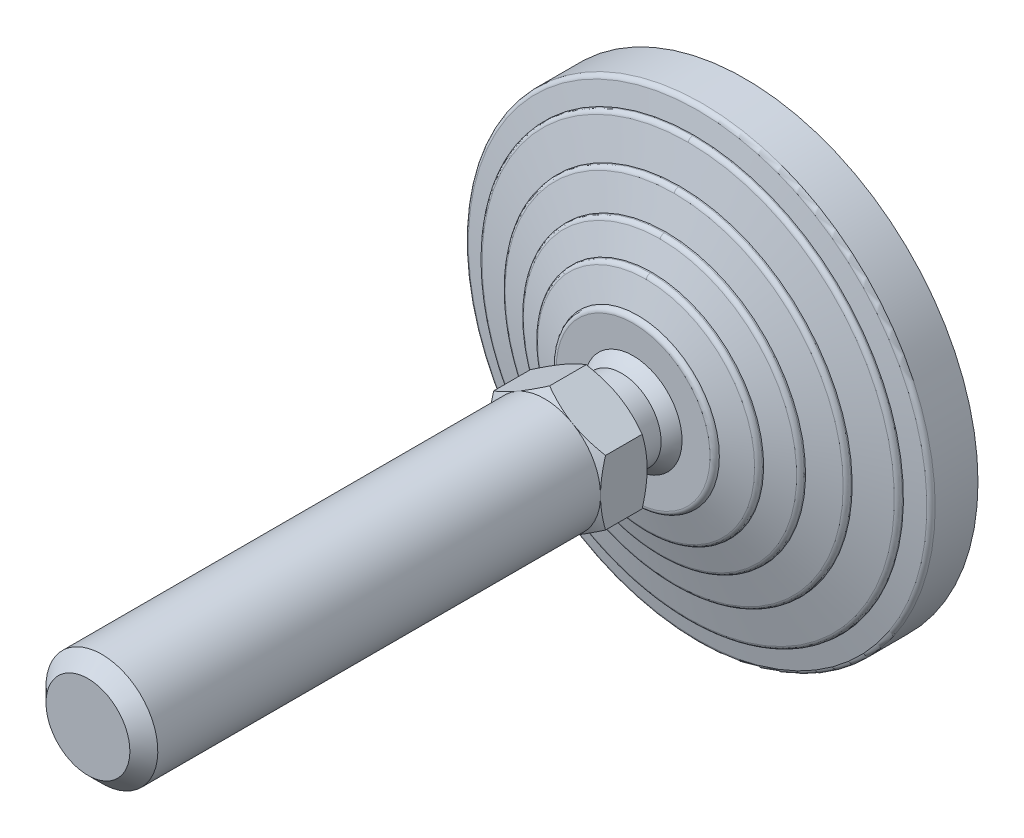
ISO-10303-21;
HEADER;
FILE_DESCRIPTION(('STEP AP214'),'2;1');
FILE_NAME('part.step','',(''),(''),'','','');
FILE_SCHEMA(('AUTOMOTIVE_DESIGN { 1 0 10303 214 1 1 1 1 }'));
ENDSEC;
DATA;
#1=APPLICATION_CONTEXT('core data for automotive mechanical design processes');
#2=APPLICATION_PROTOCOL_DEFINITION('international standard','automotive_design',2000,#1);
#3=PRODUCT_CONTEXT('',#1,'mechanical');
#4=PRODUCT('Part','Part','',(#3));
#5=PRODUCT_RELATED_PRODUCT_CATEGORY('part','',(#4));
#6=PRODUCT_DEFINITION_FORMATION('','',#4);
#7=PRODUCT_DEFINITION_CONTEXT('part definition',#1,'design');
#8=PRODUCT_DEFINITION('design','',#6,#7);
#9=PRODUCT_DEFINITION_SHAPE('','',#8);
#10=(LENGTH_UNIT() NAMED_UNIT(*) SI_UNIT(.MILLI.,.METRE.));
#11=(NAMED_UNIT(*) PLANE_ANGLE_UNIT() SI_UNIT($,.RADIAN.));
#12=(NAMED_UNIT(*) SI_UNIT($,.STERADIAN.) SOLID_ANGLE_UNIT());
#13=UNCERTAINTY_MEASURE_WITH_UNIT(LENGTH_MEASURE(1.E-05),#10,'distance_accuracy_value','');
#14=(GEOMETRIC_REPRESENTATION_CONTEXT(3) GLOBAL_UNCERTAINTY_ASSIGNED_CONTEXT((#13)) GLOBAL_UNIT_ASSIGNED_CONTEXT((#10,
#11,#12)) REPRESENTATION_CONTEXT('',''));
#15=CARTESIAN_POINT('',(0.,0.,0.));
#16=DIRECTION('',(0.,0.,1.));
#17=DIRECTION('',(1.,0.,0.));
#18=AXIS2_PLACEMENT_3D('',#15,#16,#17);
#19=CARTESIAN_POINT('',(-50.774113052,50.6,0.));
#20=DIRECTION('',(0.,0.,1.));
#21=DIRECTION('',(0.,-1.,0.));
#22=AXIS2_PLACEMENT_3D('',#19,#20,#21);
#23=PLANE('',#22);
#24=CARTESIAN_POINT('',(0.,0.,0.));
#25=DIRECTION('',(0.,0.,-1.));
#26=DIRECTION('',(1.,0.,0.));
#27=AXIS2_PLACEMENT_3D('',#24,#25,#26);
#28=CIRCLE('',#27,50.);
#29=CARTESIAN_POINT('',(50.,0.,0.));
#30=VERTEX_POINT('',#29);
#31=EDGE_CURVE('E441',#30,#30,#28,.F.);
#32=ORIENTED_EDGE('',*,*,#31,.F.);
#33=EDGE_LOOP('',(#32));
#34=FACE_BOUND('',#33,.T.);
#35=ADVANCED_FACE('F14',(#34),#23,.F.);
#36=CARTESIAN_POINT('',(0.,0.,9.180196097));
#37=DIRECTION('',(0.,0.,-1.));
#38=DIRECTION('',(1.,0.,0.));
#39=AXIS2_PLACEMENT_3D('',#36,#37,#38);
#40=CYLINDRICAL_SURFACE('',#39,50.);
#41=ORIENTED_EDGE('',*,*,#31,.T.);
#42=EDGE_LOOP('',(#41));
#43=FACE_BOUND('',#42,.T.);
#44=CARTESIAN_POINT('',(0.,0.,9.180196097));
#45=DIRECTION('',(0.,0.,1.));
#46=DIRECTION('',(0.,-1.,0.));
#47=AXIS2_PLACEMENT_3D('',#44,#45,#46);
#48=CIRCLE('',#47,50.);
#49=CARTESIAN_POINT('',(0.,-50.,9.180196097));
#50=VERTEX_POINT('',#49);
#51=EDGE_CURVE('E444',#50,#50,#48,.T.);
#52=ORIENTED_EDGE('',*,*,#51,.F.);
#53=EDGE_LOOP('',(#52));
#54=FACE_BOUND('',#53,.T.);
#55=ADVANCED_FACE('F291',(#43,#54),#40,.T.);
#56=CARTESIAN_POINT('',(0.,0.,9.180196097));
#57=DIRECTION('',(0.,0.,-1.));
#58=DIRECTION('',(0.,1.,0.));
#59=AXIS2_PLACEMENT_3D('',#56,#57,#58);
#60=TOROIDAL_SURFACE('',#59,48.9999999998,1.0000000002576);
#61=ORIENTED_EDGE('',*,*,#51,.T.);
#62=EDGE_LOOP('',(#61));
#63=FACE_BOUND('',#62,.T.);
#64=CARTESIAN_POINT('',(0.,0.,10.1607767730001));
#65=DIRECTION('',(0.,0.,-1.));
#66=DIRECTION('',(0.,1.,0.));
#67=AXIS2_PLACEMENT_3D('',#64,#65,#66);
#68=CIRCLE('',#67,49.196116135);
#69=CARTESIAN_POINT('',(0.,49.196116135,10.160776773));
#70=VERTEX_POINT('',#69);
#71=EDGE_CURVE('E445',#70,#70,#68,.F.);
#72=ORIENTED_EDGE('',*,*,#71,.F.);
#73=EDGE_LOOP('',(#72));
#74=FACE_BOUND('',#73,.T.);
#75=ADVANCED_FACE('F287',(#63,#74),#60,.T.);
#76=CARTESIAN_POINT('',(0.,0.,11.));
#77=DIRECTION('',(0.,0.,-1.));
#78=DIRECTION('',(0.,1.,0.));
#79=AXIS2_PLACEMENT_3D('',#76,#77,#78);
#80=CONICAL_SURFACE('',#79,45.,1.37340076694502);
#81=ORIENTED_EDGE('',*,*,#71,.T.);
#82=EDGE_LOOP('',(#81));
#83=FACE_BOUND('',#82,.T.);
#84=CARTESIAN_POINT('',(0.,0.,11.));
#85=DIRECTION('',(0.,0.,-1.));
#86=DIRECTION('',(0.,1.,0.));
#87=AXIS2_PLACEMENT_3D('',#84,#85,#86);
#88=CIRCLE('',#87,45.);
#89=CARTESIAN_POINT('',(0.,45.,11.));
#90=VERTEX_POINT('',#89);
#91=EDGE_CURVE('E448',#90,#90,#88,.F.);
#92=ORIENTED_EDGE('',*,*,#91,.F.);
#93=EDGE_LOOP('',(#92));
#94=FACE_BOUND('',#93,.T.);
#95=ADVANCED_FACE('F290',(#83,#94),#80,.T.);
#96=CARTESIAN_POINT('',(0.,0.,11.219223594));
#97=DIRECTION('',(0.,0.,-1.));
#98=DIRECTION('',(0.,1.,0.));
#99=AXIS2_PLACEMENT_3D('',#96,#97,#98);
#100=CYLINDRICAL_SURFACE('',#99,45.);
#101=ORIENTED_EDGE('',*,*,#91,.T.);
#102=EDGE_LOOP('',(#101));
#103=FACE_BOUND('',#102,.T.);
#104=CARTESIAN_POINT('',(0.,0.,11.219223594));
#105=DIRECTION('',(0.,0.,1.));
#106=DIRECTION('',(0.,-1.,0.));
#107=AXIS2_PLACEMENT_3D('',#104,#105,#106);
#108=CIRCLE('',#107,45.);
#109=CARTESIAN_POINT('',(-4.61482714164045E-09,-45.,11.219223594));
#110=VERTEX_POINT('',#109);
#111=CARTESIAN_POINT('',(0.,45.,11.219223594));
#112=VERTEX_POINT('',#111);
#113=EDGE_CURVE('E650',#110,#112,#108,.T.);
#114=ORIENTED_EDGE('',*,*,#113,.F.);
#115=CARTESIAN_POINT('',(0.,0.,11.219223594));
#116=DIRECTION('',(0.,0.,1.));
#117=DIRECTION('',(0.,-1.,0.));
#118=AXIS2_PLACEMENT_3D('',#115,#116,#117);
#119=CIRCLE('',#118,45.);
#120=EDGE_CURVE('E661',#112,#110,#119,.T.);
#121=ORIENTED_EDGE('',*,*,#120,.F.);
#122=EDGE_LOOP('',(#114,#121));
#123=FACE_BOUND('',#122,.T.);
#124=ADVANCED_FACE('F420',(#103,#123),#100,.T.);
#125=CARTESIAN_POINT('',(0.,-45.,11.219223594));
#126=CARTESIAN_POINT('',(-90.0000000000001,-45.,11.219223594));
#127=CARTESIAN_POINT('',(-90.0000000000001,45.,11.219223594));
#128=CARTESIAN_POINT('',(0.,45.,11.219223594));
#129=CARTESIAN_POINT('',(0.,-45.,11.696951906));
#130=CARTESIAN_POINT('',(-90.,-45.,11.696951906));
#131=CARTESIAN_POINT('',(-90.,45.,11.696951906));
#132=CARTESIAN_POINT('',(0.,45.,11.696951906));
#133=CARTESIAN_POINT('',(0.,-44.706000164,12.073499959));
#134=CARTESIAN_POINT('',(-89.4120003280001,-44.7060001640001,12.073499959));
#135=CARTESIAN_POINT('',(-89.4120003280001,44.7060001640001,12.073499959));
#136=CARTESIAN_POINT('',(0.,44.706000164,12.073499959));
#137=CARTESIAN_POINT('',(0.,-44.242535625,12.189366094));
#138=CARTESIAN_POINT('',(-88.4850712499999,-44.2425356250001,12.189366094));
#139=CARTESIAN_POINT('',(-88.4850712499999,44.2425356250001,12.189366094));
#140=CARTESIAN_POINT('',(0.,44.242535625,12.189366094));
#141=(BOUNDED_SURFACE() B_SPLINE_SURFACE(3,3,((#125,#126,#127,#128),(#129,#130,#131,#132),(#133,
#134,#135,#136),(#137,#138,#139,#140)),.UNSPECIFIED.,.F.,.F.,
.F.) B_SPLINE_SURFACE_WITH_KNOTS((4,4),(4,4),(0.,1.),(0.,1.),
.UNSPECIFIED.) GEOMETRIC_REPRESENTATION_ITEM() RATIONAL_B_SPLINE_SURFACE(((1.,0.333333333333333,
0.333333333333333,1.),(0.858803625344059,0.286267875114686,0.286267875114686,0.858803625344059),
(0.858803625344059,0.286267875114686,0.286267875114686,0.858803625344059),(1.,0.333333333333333,
0.333333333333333,1.))) REPRESENTATION_ITEM('') SURFACE());
#142=CARTESIAN_POINT('',(0.,45.,11.219223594));
#143=CARTESIAN_POINT('',(0.,45.,11.696951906));
#144=CARTESIAN_POINT('',(0.,44.706000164,12.073499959));
#145=CARTESIAN_POINT('',(0.,44.242535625,12.189366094));
#146=(BOUNDED_CURVE() B_SPLINE_CURVE(3,(#142,#143,#144,#145),.UNSPECIFIED.,.F.,
.F.) B_SPLINE_CURVE_WITH_KNOTS((4,4),(0.,1.),
.UNSPECIFIED.) CURVE() GEOMETRIC_REPRESENTATION_ITEM() RATIONAL_B_SPLINE_CURVE((1.,
0.858803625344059,0.858803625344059,1.)) REPRESENTATION_ITEM(''));
#147=CARTESIAN_POINT('',(0.,44.242535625,12.189366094));
#148=VERTEX_POINT('',#147);
#149=EDGE_CURVE('E641',#112,#148,#146,.T.);
#150=CARTESIAN_POINT('',(0.,-45.,11.219223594));
#151=CARTESIAN_POINT('',(0.,-45.,11.696951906));
#152=CARTESIAN_POINT('',(0.,-44.706000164,12.073499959));
#153=CARTESIAN_POINT('',(0.,-44.242535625,12.189366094));
#154=(BOUNDED_CURVE() B_SPLINE_CURVE(3,(#150,#151,#152,#153),.UNSPECIFIED.,.F.,
.F.) B_SPLINE_CURVE_WITH_KNOTS((4,4),(0.,1.),
.UNSPECIFIED.) CURVE() GEOMETRIC_REPRESENTATION_ITEM() RATIONAL_B_SPLINE_CURVE((1.,
0.858803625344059,0.858803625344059,1.)) REPRESENTATION_ITEM(''));
#155=CARTESIAN_POINT('',(-1.3611443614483E-08,-44.242535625,12.189366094));
#156=VERTEX_POINT('',#155);
#157=EDGE_CURVE('E655',#156,#110,#154,.F.);
#158=CARTESIAN_POINT('',(0.,0.,12.189366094));
#159=DIRECTION('',(0.,0.,-1.));
#160=DIRECTION('',(0.,1.,0.));
#161=AXIS2_PLACEMENT_3D('',#158,#159,#160);
#162=CIRCLE('',#161,44.242535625);
#163=EDGE_CURVE('E638',#148,#156,#162,.F.);
#164=ORIENTED_EDGE('',*,*,#149,.F.);
#165=ORIENTED_EDGE('',*,*,#120,.T.);
#166=ORIENTED_EDGE('',*,*,#157,.F.);
#167=ORIENTED_EDGE('',*,*,#163,.F.);
#168=EDGE_LOOP('',(#164,#165,#166,#167));
#169=FACE_BOUND('',#168,.T.);
#170=ADVANCED_FACE('F409',(#169),#141,.T.);
#171=CARTESIAN_POINT('',(0.,45.,11.219223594));
#172=CARTESIAN_POINT('',(90.0000000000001,45.,11.219223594));
#173=CARTESIAN_POINT('',(90.0000000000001,-45.,11.219223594));
#174=CARTESIAN_POINT('',(0.,-45.,11.219223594));
#175=CARTESIAN_POINT('',(0.,45.,11.696951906));
#176=CARTESIAN_POINT('',(90.,45.,11.696951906));
#177=CARTESIAN_POINT('',(90.,-45.,11.696951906));
#178=CARTESIAN_POINT('',(0.,-45.,11.696951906));
#179=CARTESIAN_POINT('',(0.,44.706000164,12.073499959));
#180=CARTESIAN_POINT('',(89.4120003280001,44.7060001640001,12.073499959));
#181=CARTESIAN_POINT('',(89.4120003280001,-44.7060001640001,12.073499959));
#182=CARTESIAN_POINT('',(0.,-44.706000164,12.073499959));
#183=CARTESIAN_POINT('',(0.,44.242535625,12.189366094));
#184=CARTESIAN_POINT('',(88.4850712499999,44.2425356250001,12.189366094));
#185=CARTESIAN_POINT('',(88.4850712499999,-44.2425356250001,12.189366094));
#186=CARTESIAN_POINT('',(0.,-44.242535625,12.189366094));
#187=(BOUNDED_SURFACE() B_SPLINE_SURFACE(3,3,((#171,#172,#173,#174),(#175,#176,#177,#178),(#179,
#180,#181,#182),(#183,#184,#185,#186)),.UNSPECIFIED.,.F.,.F.,
.F.) B_SPLINE_SURFACE_WITH_KNOTS((4,4),(4,4),(0.,1.),(0.,1.),
.UNSPECIFIED.) GEOMETRIC_REPRESENTATION_ITEM() RATIONAL_B_SPLINE_SURFACE(((1.,0.333333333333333,
0.333333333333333,1.),(0.858803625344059,0.286267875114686,0.286267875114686,0.858803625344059),
(0.858803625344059,0.286267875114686,0.286267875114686,0.858803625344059),(1.,0.333333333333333,
0.333333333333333,1.))) REPRESENTATION_ITEM('') SURFACE());
#188=CARTESIAN_POINT('',(0.,0.,12.189366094));
#189=DIRECTION('',(0.,0.,-1.));
#190=DIRECTION('',(0.,1.,0.));
#191=AXIS2_PLACEMENT_3D('',#188,#189,#190);
#192=CIRCLE('',#191,44.242535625);
#193=EDGE_CURVE('E637',#156,#148,#192,.F.);
#194=ORIENTED_EDGE('',*,*,#113,.T.);
#195=ORIENTED_EDGE('',*,*,#149,.T.);
#196=ORIENTED_EDGE('',*,*,#193,.F.);
#197=ORIENTED_EDGE('',*,*,#157,.T.);
#198=EDGE_LOOP('',(#194,#195,#196,#197));
#199=FACE_BOUND('',#198,.T.);
#200=ADVANCED_FACE('F403',(#199),#187,.T.);
#201=CARTESIAN_POINT('',(0.,0.,14.));
#202=DIRECTION('',(0.,0.,-1.));
#203=DIRECTION('',(1.,0.,0.));
#204=AXIS2_PLACEMENT_3D('',#201,#202,#203);
#205=CONICAL_SURFACE('',#204,37.,1.32581766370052);
#206=ORIENTED_EDGE('',*,*,#163,.T.);
#207=ORIENTED_EDGE('',*,*,#193,.T.);
#208=EDGE_LOOP('',(#206,#207));
#209=FACE_BOUND('',#208,.T.);
#210=CARTESIAN_POINT('',(0.,0.,14.));
#211=DIRECTION('',(0.,0.,-1.));
#212=DIRECTION('',(0.,1.,0.));
#213=AXIS2_PLACEMENT_3D('',#210,#211,#212);
#214=CIRCLE('',#213,37.);
#215=CARTESIAN_POINT('',(0.,37.,14.));
#216=VERTEX_POINT('',#215);
#217=EDGE_CURVE('E628',#216,#216,#214,.F.);
#218=ORIENTED_EDGE('',*,*,#217,.F.);
#219=EDGE_LOOP('',(#218));
#220=FACE_BOUND('',#219,.T.);
#221=ADVANCED_FACE('F399',(#209,#220),#205,.T.);
#222=CARTESIAN_POINT('',(0.,0.,14.245698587));
#223=DIRECTION('',(0.,0.,-1.));
#224=DIRECTION('',(1.,0.,0.));
#225=AXIS2_PLACEMENT_3D('',#222,#223,#224);
#226=CYLINDRICAL_SURFACE('',#225,37.);
#227=ORIENTED_EDGE('',*,*,#217,.T.);
#228=EDGE_LOOP('',(#227));
#229=FACE_BOUND('',#228,.T.);
#230=CARTESIAN_POINT('',(0.,0.,14.245698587));
#231=DIRECTION('',(0.,0.,1.));
#232=DIRECTION('',(0.,-1.,0.));
#233=AXIS2_PLACEMENT_3D('',#230,#231,#232);
#234=CIRCLE('',#233,37.);
#235=CARTESIAN_POINT('',(-3.79441342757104E-09,-37.,14.245698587));
#236=VERTEX_POINT('',#235);
#237=CARTESIAN_POINT('',(0.,37.,14.245698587));
#238=VERTEX_POINT('',#237);
#239=EDGE_CURVE('E608',#236,#238,#234,.T.);
#240=ORIENTED_EDGE('',*,*,#239,.F.);
#241=CARTESIAN_POINT('',(0.,0.,14.245698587));
#242=DIRECTION('',(0.,0.,1.));
#243=DIRECTION('',(0.,-1.,0.));
#244=AXIS2_PLACEMENT_3D('',#241,#242,#243);
#245=CIRCLE('',#244,37.);
#246=EDGE_CURVE('E619',#238,#236,#245,.T.);
#247=ORIENTED_EDGE('',*,*,#246,.F.);
#248=EDGE_LOOP('',(#240,#247));
#249=FACE_BOUND('',#248,.T.);
#250=ADVANCED_FACE('F390',(#229,#249),#226,.T.);
#251=CARTESIAN_POINT('',(0.,-37.,14.245698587));
#252=CARTESIAN_POINT('',(-74.,-37.,14.245698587));
#253=CARTESIAN_POINT('',(-74.,37.,14.245698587));
#254=CARTESIAN_POINT('',(0.,37.,14.245698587));
#255=CARTESIAN_POINT('',(0.,-37.,14.709515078));
#256=CARTESIAN_POINT('',(-73.9999999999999,-37.,14.709515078));
#257=CARTESIAN_POINT('',(-73.9999999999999,37.,14.709515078));
#258=CARTESIAN_POINT('',(0.,37.,14.709515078));
#259=CARTESIAN_POINT('',(0.,-36.720691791,15.079802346));
#260=CARTESIAN_POINT('',(-73.4413835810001,-36.720691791,15.079802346));
#261=CARTESIAN_POINT('',(-73.4413835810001,36.720691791,15.079802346));
#262=CARTESIAN_POINT('',(0.,36.720691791,15.079802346));
#263=CARTESIAN_POINT('',(0.,-36.274721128,15.207222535));
#264=CARTESIAN_POINT('',(-72.549442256,-36.274721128,15.207222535));
#265=CARTESIAN_POINT('',(-72.549442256,36.274721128,15.207222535));
#266=CARTESIAN_POINT('',(0.,36.274721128,15.207222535));
#267=(BOUNDED_SURFACE() B_SPLINE_SURFACE(3,3,((#251,#252,#253,#254),(#255,#256,#257,#258),(#259,
#260,#261,#262),(#263,#264,#265,#266)),.UNSPECIFIED.,.F.,.F.,
.F.) B_SPLINE_SURFACE_WITH_KNOTS((4,4),(4,4),(0.,1.),(0.,1.),
.UNSPECIFIED.) GEOMETRIC_REPRESENTATION_ITEM() RATIONAL_B_SPLINE_SURFACE(((1.,0.333333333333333,
0.333333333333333,1.),(0.865565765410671,0.288521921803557,0.288521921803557,0.865565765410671),
(0.865565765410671,0.288521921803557,0.288521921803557,0.865565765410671),(1.,0.333333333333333,
0.333333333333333,1.))) REPRESENTATION_ITEM('') SURFACE());
#268=CARTESIAN_POINT('',(0.,37.,14.245698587));
#269=CARTESIAN_POINT('',(0.,37.,14.709515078));
#270=CARTESIAN_POINT('',(0.,36.720691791,15.079802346));
#271=CARTESIAN_POINT('',(0.,36.274721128,15.207222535));
#272=(BOUNDED_CURVE() B_SPLINE_CURVE(3,(#268,#269,#270,#271),.UNSPECIFIED.,.F.,
.F.) B_SPLINE_CURVE_WITH_KNOTS((4,4),(0.,1.),
.UNSPECIFIED.) CURVE() GEOMETRIC_REPRESENTATION_ITEM() RATIONAL_B_SPLINE_CURVE((1.,
0.865565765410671,0.865565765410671,1.)) REPRESENTATION_ITEM(''));
#273=CARTESIAN_POINT('',(0.,36.274721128,15.2072225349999));
#274=VERTEX_POINT('',#273);
#275=EDGE_CURVE('E599',#238,#274,#272,.T.);
#276=CARTESIAN_POINT('',(0.,-37.,14.245698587));
#277=CARTESIAN_POINT('',(0.,-37.,14.709515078));
#278=CARTESIAN_POINT('',(0.,-36.720691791,15.079802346));
#279=CARTESIAN_POINT('',(0.,-36.274721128,15.207222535));
#280=(BOUNDED_CURVE() B_SPLINE_CURVE(3,(#276,#277,#278,#279),.UNSPECIFIED.,.F.,
.F.) B_SPLINE_CURVE_WITH_KNOTS((4,4),(0.,1.),
.UNSPECIFIED.) CURVE() GEOMETRIC_REPRESENTATION_ITEM() RATIONAL_B_SPLINE_CURVE((1.,
0.865565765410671,0.865565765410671,1.)) REPRESENTATION_ITEM(''));
#281=CARTESIAN_POINT('',(-1.11601045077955E-08,-36.274721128,15.2072225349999));
#282=VERTEX_POINT('',#281);
#283=EDGE_CURVE('E613',#282,#236,#280,.F.);
#284=CARTESIAN_POINT('',(0.,0.,15.2072225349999));
#285=DIRECTION('',(0.,0.,-1.));
#286=DIRECTION('',(0.,1.,0.));
#287=AXIS2_PLACEMENT_3D('',#284,#285,#286);
#288=CIRCLE('',#287,36.274721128);
#289=EDGE_CURVE('E596',#274,#282,#288,.F.);
#290=ORIENTED_EDGE('',*,*,#275,.F.);
#291=ORIENTED_EDGE('',*,*,#246,.T.);
#292=ORIENTED_EDGE('',*,*,#283,.F.);
#293=ORIENTED_EDGE('',*,*,#289,.F.);
#294=EDGE_LOOP('',(#290,#291,#292,#293));
#295=FACE_BOUND('',#294,.T.);
#296=ADVANCED_FACE('F379',(#295),#267,.T.);
#297=CARTESIAN_POINT('',(0.,37.,14.245698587));
#298=CARTESIAN_POINT('',(74.,37.,14.245698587));
#299=CARTESIAN_POINT('',(74.,-37.,14.245698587));
#300=CARTESIAN_POINT('',(0.,-37.,14.245698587));
#301=CARTESIAN_POINT('',(0.,37.,14.709515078));
#302=CARTESIAN_POINT('',(73.9999999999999,37.,14.709515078));
#303=CARTESIAN_POINT('',(73.9999999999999,-37.,14.709515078));
#304=CARTESIAN_POINT('',(0.,-37.,14.709515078));
#305=CARTESIAN_POINT('',(0.,36.720691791,15.079802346));
#306=CARTESIAN_POINT('',(73.4413835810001,36.720691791,15.079802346));
#307=CARTESIAN_POINT('',(73.4413835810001,-36.720691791,15.079802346));
#308=CARTESIAN_POINT('',(0.,-36.720691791,15.079802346));
#309=CARTESIAN_POINT('',(0.,36.274721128,15.207222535));
#310=CARTESIAN_POINT('',(72.549442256,36.274721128,15.207222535));
#311=CARTESIAN_POINT('',(72.549442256,-36.274721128,15.207222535));
#312=CARTESIAN_POINT('',(0.,-36.274721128,15.207222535));
#313=(BOUNDED_SURFACE() B_SPLINE_SURFACE(3,3,((#297,#298,#299,#300),(#301,#302,#303,#304),(#305,
#306,#307,#308),(#309,#310,#311,#312)),.UNSPECIFIED.,.F.,.F.,
.F.) B_SPLINE_SURFACE_WITH_KNOTS((4,4),(4,4),(0.,1.),(0.,1.),
.UNSPECIFIED.) GEOMETRIC_REPRESENTATION_ITEM() RATIONAL_B_SPLINE_SURFACE(((1.,0.333333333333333,
0.333333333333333,1.),(0.865565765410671,0.288521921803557,0.288521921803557,0.865565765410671),
(0.865565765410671,0.288521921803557,0.288521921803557,0.865565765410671),(1.,0.333333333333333,
0.333333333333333,1.))) REPRESENTATION_ITEM('') SURFACE());
#314=CARTESIAN_POINT('',(0.,0.,15.2072225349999));
#315=DIRECTION('',(0.,0.,-1.));
#316=DIRECTION('',(0.,1.,0.));
#317=AXIS2_PLACEMENT_3D('',#314,#315,#316);
#318=CIRCLE('',#317,36.274721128);
#319=EDGE_CURVE('E595',#282,#274,#318,.F.);
#320=ORIENTED_EDGE('',*,*,#239,.T.);
#321=ORIENTED_EDGE('',*,*,#275,.T.);
#322=ORIENTED_EDGE('',*,*,#319,.F.);
#323=ORIENTED_EDGE('',*,*,#283,.T.);
#324=EDGE_LOOP('',(#320,#321,#322,#323));
#325=FACE_BOUND('',#324,.T.);
#326=ADVANCED_FACE('F373',(#325),#313,.T.);
#327=CARTESIAN_POINT('',(0.,0.,17.));
#328=DIRECTION('',(0.,0.,-1.));
#329=DIRECTION('',(0.,1.,0.));
#330=AXIS2_PLACEMENT_3D('',#327,#328,#329);
#331=CONICAL_SURFACE('',#330,30.,1.29249666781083);
#332=ORIENTED_EDGE('',*,*,#289,.T.);
#333=ORIENTED_EDGE('',*,*,#319,.T.);
#334=EDGE_LOOP('',(#332,#333));
#335=FACE_BOUND('',#334,.T.);
#336=CARTESIAN_POINT('',(0.,0.,17.));
#337=DIRECTION('',(0.,0.,-1.));
#338=DIRECTION('',(0.,1.,0.));
#339=AXIS2_PLACEMENT_3D('',#336,#337,#338);
#340=CIRCLE('',#339,30.);
#341=CARTESIAN_POINT('',(0.,30.,17.));
#342=VERTEX_POINT('',#341);
#343=EDGE_CURVE('E586',#342,#342,#340,.F.);
#344=ORIENTED_EDGE('',*,*,#343,.F.);
#345=EDGE_LOOP('',(#344));
#346=FACE_BOUND('',#345,.T.);
#347=ADVANCED_FACE('F369',(#335,#346),#331,.T.);
#348=CARTESIAN_POINT('',(0.,0.,17.27924078));
#349=DIRECTION('',(0.,0.,-1.));
#350=DIRECTION('',(0.,1.,0.));
#351=AXIS2_PLACEMENT_3D('',#348,#349,#350);
#352=CYLINDRICAL_SURFACE('',#351,30.);
#353=ORIENTED_EDGE('',*,*,#343,.T.);
#354=EDGE_LOOP('',(#353));
#355=FACE_BOUND('',#354,.T.);
#356=CARTESIAN_POINT('',(0.,0.,17.27924078));
#357=DIRECTION('',(0.,0.,1.));
#358=DIRECTION('',(0.,-1.,0.));
#359=AXIS2_PLACEMENT_3D('',#356,#357,#358);
#360=CIRCLE('',#359,30.);
#361=CARTESIAN_POINT('',(-3.0765514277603E-09,-30.,17.27924078));
#362=VERTEX_POINT('',#361);
#363=CARTESIAN_POINT('',(0.,30.,17.27924078));
#364=VERTEX_POINT('',#363);
#365=EDGE_CURVE('E566',#362,#364,#360,.T.);
#366=ORIENTED_EDGE('',*,*,#365,.F.);
#367=CARTESIAN_POINT('',(0.,0.,17.27924078));
#368=DIRECTION('',(0.,0.,1.));
#369=DIRECTION('',(0.,-1.,0.));
#370=AXIS2_PLACEMENT_3D('',#367,#368,#369);
#371=CIRCLE('',#370,30.);
#372=EDGE_CURVE('E577',#364,#362,#371,.T.);
#373=ORIENTED_EDGE('',*,*,#372,.F.);
#374=EDGE_LOOP('',(#366,#373));
#375=FACE_BOUND('',#374,.T.);
#376=ADVANCED_FACE('F360',(#355,#375),#352,.T.);
#377=CARTESIAN_POINT('',(0.,-30.,17.27924078));
#378=CARTESIAN_POINT('',(-60.0000000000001,-30.,17.27924078));
#379=CARTESIAN_POINT('',(-60.0000000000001,30.,17.27924078));
#380=CARTESIAN_POINT('',(0.,30.,17.27924078));
#381=CARTESIAN_POINT('',(0.,-30.,17.725161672));
#382=CARTESIAN_POINT('',(-60.,-30.,17.725161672));
#383=CARTESIAN_POINT('',(-60.,30.,17.725161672));
#384=CARTESIAN_POINT('',(0.,30.,17.725161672));
#385=CARTESIAN_POINT('',(0.,-29.739265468,18.086911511));
#386=CARTESIAN_POINT('',(-59.478530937,-29.739265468,18.086911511));
#387=CARTESIAN_POINT('',(-59.478530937,29.739265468,18.086911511));
#388=CARTESIAN_POINT('',(0.,29.739265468,18.086911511));
#389=CARTESIAN_POINT('',(0.,-29.316227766,18.227924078));
#390=CARTESIAN_POINT('',(-58.6324555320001,-29.316227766,18.227924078));
#391=CARTESIAN_POINT('',(-58.6324555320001,29.316227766,18.227924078));
#392=CARTESIAN_POINT('',(0.,29.316227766,18.227924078));
#393=(BOUNDED_SURFACE() B_SPLINE_SURFACE(3,3,((#377,#378,#379,#380),(#381,#382,#383,#384),(#385,
#386,#387,#388),(#389,#390,#391,#392)),.UNSPECIFIED.,.F.,.F.,
.F.) B_SPLINE_SURFACE_WITH_KNOTS((4,4),(4,4),(0.,1.),(0.,1.),
.UNSPECIFIED.) GEOMETRIC_REPRESENTATION_ITEM() RATIONAL_B_SPLINE_SURFACE(((1.,0.333333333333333,
0.333333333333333,1.),(0.874161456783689,0.29138715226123,0.29138715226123,0.874161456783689),
(0.874161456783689,0.29138715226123,0.29138715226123,0.874161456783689),(1.,0.333333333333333,
0.333333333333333,1.))) REPRESENTATION_ITEM('') SURFACE());
#394=CARTESIAN_POINT('',(0.,30.,17.27924078));
#395=CARTESIAN_POINT('',(0.,30.,17.725161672));
#396=CARTESIAN_POINT('',(0.,29.739265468,18.086911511));
#397=CARTESIAN_POINT('',(0.,29.316227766,18.227924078));
#398=(BOUNDED_CURVE() B_SPLINE_CURVE(3,(#394,#395,#396,#397),.UNSPECIFIED.,.F.,
.F.) B_SPLINE_CURVE_WITH_KNOTS((4,4),(0.,1.),
.UNSPECIFIED.) CURVE() GEOMETRIC_REPRESENTATION_ITEM() RATIONAL_B_SPLINE_CURVE((1.,
0.874161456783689,0.874161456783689,1.)) REPRESENTATION_ITEM(''));
#399=CARTESIAN_POINT('',(0.,29.3162277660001,18.2279240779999));
#400=VERTEX_POINT('',#399);
#401=EDGE_CURVE('E557',#364,#400,#398,.T.);
#402=CARTESIAN_POINT('',(0.,-30.,17.27924078));
#403=CARTESIAN_POINT('',(0.,-30.,17.725161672));
#404=CARTESIAN_POINT('',(0.,-29.739265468,18.086911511));
#405=CARTESIAN_POINT('',(0.,-29.316227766,18.227924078));
#406=(BOUNDED_CURVE() B_SPLINE_CURVE(3,(#402,#403,#404,#405),.UNSPECIFIED.,.F.,
.F.) B_SPLINE_CURVE_WITH_KNOTS((4,4),(0.,1.),
.UNSPECIFIED.) CURVE() GEOMETRIC_REPRESENTATION_ITEM() RATIONAL_B_SPLINE_CURVE((1.,
0.874161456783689,0.874161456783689,1.)) REPRESENTATION_ITEM(''));
#407=CARTESIAN_POINT('',(-9.01928823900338E-09,-29.3162277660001,18.2279240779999));
#408=VERTEX_POINT('',#407);
#409=EDGE_CURVE('E571',#408,#362,#406,.F.);
#410=CARTESIAN_POINT('',(0.,0.,18.2279240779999));
#411=DIRECTION('',(0.,0.,-1.));
#412=DIRECTION('',(0.,1.,0.));
#413=AXIS2_PLACEMENT_3D('',#410,#411,#412);
#414=CIRCLE('',#413,29.316227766);
#415=EDGE_CURVE('E554',#400,#408,#414,.F.);
#416=ORIENTED_EDGE('',*,*,#401,.F.);
#417=ORIENTED_EDGE('',*,*,#372,.T.);
#418=ORIENTED_EDGE('',*,*,#409,.F.);
#419=ORIENTED_EDGE('',*,*,#415,.F.);
#420=EDGE_LOOP('',(#416,#417,#418,#419));
#421=FACE_BOUND('',#420,.T.);
#422=ADVANCED_FACE('F349',(#421),#393,.T.);
#423=CARTESIAN_POINT('',(0.,30.,17.27924078));
#424=CARTESIAN_POINT('',(60.0000000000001,30.,17.27924078));
#425=CARTESIAN_POINT('',(60.0000000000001,-30.,17.27924078));
#426=CARTESIAN_POINT('',(0.,-30.,17.27924078));
#427=CARTESIAN_POINT('',(0.,30.,17.725161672));
#428=CARTESIAN_POINT('',(60.,30.,17.725161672));
#429=CARTESIAN_POINT('',(60.,-30.,17.725161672));
#430=CARTESIAN_POINT('',(0.,-30.,17.725161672));
#431=CARTESIAN_POINT('',(0.,29.739265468,18.086911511));
#432=CARTESIAN_POINT('',(59.478530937,29.739265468,18.086911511));
#433=CARTESIAN_POINT('',(59.478530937,-29.739265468,18.086911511));
#434=CARTESIAN_POINT('',(0.,-29.739265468,18.086911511));
#435=CARTESIAN_POINT('',(0.,29.316227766,18.227924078));
#436=CARTESIAN_POINT('',(58.6324555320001,29.316227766,18.227924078));
#437=CARTESIAN_POINT('',(58.6324555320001,-29.316227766,18.227924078));
#438=CARTESIAN_POINT('',(0.,-29.316227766,18.227924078));
#439=(BOUNDED_SURFACE() B_SPLINE_SURFACE(3,3,((#423,#424,#425,#426),(#427,#428,#429,#430),(#431,
#432,#433,#434),(#435,#436,#437,#438)),.UNSPECIFIED.,.F.,.F.,
.F.) B_SPLINE_SURFACE_WITH_KNOTS((4,4),(4,4),(0.,1.),(0.,1.),
.UNSPECIFIED.) GEOMETRIC_REPRESENTATION_ITEM() RATIONAL_B_SPLINE_SURFACE(((1.,0.333333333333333,
0.333333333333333,1.),(0.874161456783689,0.29138715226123,0.29138715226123,0.874161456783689),
(0.874161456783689,0.29138715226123,0.29138715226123,0.874161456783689),(1.,0.333333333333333,
0.333333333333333,1.))) REPRESENTATION_ITEM('') SURFACE());
#440=CARTESIAN_POINT('',(0.,0.,18.2279240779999));
#441=DIRECTION('',(0.,0.,-1.));
#442=DIRECTION('',(0.,1.,0.));
#443=AXIS2_PLACEMENT_3D('',#440,#441,#442);
#444=CIRCLE('',#443,29.316227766);
#445=EDGE_CURVE('E553',#408,#400,#444,.F.);
#446=ORIENTED_EDGE('',*,*,#365,.T.);
#447=ORIENTED_EDGE('',*,*,#401,.T.);
#448=ORIENTED_EDGE('',*,*,#445,.F.);
#449=ORIENTED_EDGE('',*,*,#409,.T.);
#450=EDGE_LOOP('',(#446,#447,#448,#449));
#451=FACE_BOUND('',#450,.T.);
#452=ADVANCED_FACE('F343',(#451),#439,.T.);
#453=CARTESIAN_POINT('',(0.,0.,20.));
#454=DIRECTION('',(0.,0.,-1.));
#455=DIRECTION('',(1.,0.,0.));
#456=AXIS2_PLACEMENT_3D('',#453,#454,#455);
#457=CONICAL_SURFACE('',#456,24.,1.24904577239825);
#458=ORIENTED_EDGE('',*,*,#415,.T.);
#459=ORIENTED_EDGE('',*,*,#445,.T.);
#460=EDGE_LOOP('',(#458,#459));
#461=FACE_BOUND('',#460,.T.);
#462=CARTESIAN_POINT('',(0.,0.,20.));
#463=DIRECTION('',(0.,0.,-1.));
#464=DIRECTION('',(0.,1.,0.));
#465=AXIS2_PLACEMENT_3D('',#462,#463,#464);
#466=CIRCLE('',#465,24.);
#467=CARTESIAN_POINT('',(0.,24.,20.));
#468=VERTEX_POINT('',#467);
#469=EDGE_CURVE('E544',#468,#468,#466,.F.);
#470=ORIENTED_EDGE('',*,*,#469,.F.);
#471=EDGE_LOOP('',(#470));
#472=FACE_BOUND('',#471,.T.);
#473=ADVANCED_FACE('F339',(#461,#472),#457,.T.);
#474=CARTESIAN_POINT('',(0.,0.,20.261425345));
#475=DIRECTION('',(0.,0.,-1.));
#476=DIRECTION('',(0.,1.,0.));
#477=AXIS2_PLACEMENT_3D('',#474,#475,#476);
#478=CYLINDRICAL_SURFACE('',#477,24.);
#479=ORIENTED_EDGE('',*,*,#469,.T.);
#480=EDGE_LOOP('',(#479));
#481=FACE_BOUND('',#480,.T.);
#482=CARTESIAN_POINT('',(0.,0.,20.261425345));
#483=DIRECTION('',(0.,0.,1.));
#484=DIRECTION('',(0.,-1.,0.));
#485=AXIS2_PLACEMENT_3D('',#482,#483,#484);
#486=CIRCLE('',#485,24.);
#487=CARTESIAN_POINT('',(-2.46124114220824E-09,-24.,20.261425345));
#488=VERTEX_POINT('',#487);
#489=CARTESIAN_POINT('',(0.,24.,20.261425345));
#490=VERTEX_POINT('',#489);
#491=EDGE_CURVE('E524',#488,#490,#486,.T.);
#492=ORIENTED_EDGE('',*,*,#491,.F.);
#493=CARTESIAN_POINT('',(0.,0.,20.261425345));
#494=DIRECTION('',(0.,0.,1.));
#495=DIRECTION('',(0.,-1.,0.));
#496=AXIS2_PLACEMENT_3D('',#493,#494,#495);
#497=CIRCLE('',#496,24.);
#498=EDGE_CURVE('E535',#490,#488,#497,.T.);
#499=ORIENTED_EDGE('',*,*,#498,.F.);
#500=EDGE_LOOP('',(#492,#499));
#501=FACE_BOUND('',#500,.T.);
#502=ADVANCED_FACE('F330',(#481,#501),#478,.T.);
#503=CARTESIAN_POINT('',(0.,-24.,20.261425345));
#504=CARTESIAN_POINT('',(-48.,-24.,20.261425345));
#505=CARTESIAN_POINT('',(-48.,24.,20.261425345));
#506=CARTESIAN_POINT('',(0.,24.,20.261425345));
#507=CARTESIAN_POINT('',(0.,-24.,20.716888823));
#508=CARTESIAN_POINT('',(-48.,-24.,20.716888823));
#509=CARTESIAN_POINT('',(-48.,24.,20.716888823));
#510=CARTESIAN_POINT('',(0.,24.,20.716888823));
#511=CARTESIAN_POINT('',(0.,-23.72940828,21.083258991));
#512=CARTESIAN_POINT('',(-47.458816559,-23.72940828,21.083258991));
#513=CARTESIAN_POINT('',(-47.458816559,23.72940828,21.083258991));
#514=CARTESIAN_POINT('',(0.,23.72940828,21.083258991));
#515=CARTESIAN_POINT('',(0.,-23.294085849,21.217204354));
#516=CARTESIAN_POINT('',(-46.5881716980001,-23.294085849,21.217204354));
#517=CARTESIAN_POINT('',(-46.5881716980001,23.294085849,21.217204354));
#518=CARTESIAN_POINT('',(0.,23.294085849,21.217204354));
#519=(BOUNDED_SURFACE() B_SPLINE_SURFACE(3,3,((#503,#504,#505,#506),(#507,#508,#509,#510),(#511,
#512,#513,#514),(#515,#516,#517,#518)),.UNSPECIFIED.,.F.,.F.,
.F.) B_SPLINE_SURFACE_WITH_KNOTS((4,4),(4,4),(0.,1.),(0.,1.),
.UNSPECIFIED.) GEOMETRIC_REPRESENTATION_ITEM() RATIONAL_B_SPLINE_SURFACE(((1.,0.333333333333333,
0.333333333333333,1.),(0.869593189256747,0.289864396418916,0.289864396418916,0.869593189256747),
(0.869593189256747,0.289864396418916,0.289864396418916,0.869593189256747),(1.,0.333333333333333,
0.333333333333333,1.))) REPRESENTATION_ITEM('') SURFACE());
#520=CARTESIAN_POINT('',(0.,24.,20.261425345));
#521=CARTESIAN_POINT('',(0.,24.,20.716888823));
#522=CARTESIAN_POINT('',(0.,23.72940828,21.083258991));
#523=CARTESIAN_POINT('',(0.,23.294085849,21.217204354));
#524=(BOUNDED_CURVE() B_SPLINE_CURVE(3,(#520,#521,#522,#523),.UNSPECIFIED.,.F.,
.F.) B_SPLINE_CURVE_WITH_KNOTS((4,4),(0.,1.),
.UNSPECIFIED.) CURVE() GEOMETRIC_REPRESENTATION_ITEM() RATIONAL_B_SPLINE_CURVE((1.,
0.869593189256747,0.869593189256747,1.)) REPRESENTATION_ITEM(''));
#525=CARTESIAN_POINT('',(0.,23.294085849,21.217204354));
#526=VERTEX_POINT('',#525);
#527=EDGE_CURVE('E515',#490,#526,#524,.T.);
#528=CARTESIAN_POINT('',(0.,-24.,20.261425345));
#529=CARTESIAN_POINT('',(0.,-24.,20.716888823));
#530=CARTESIAN_POINT('',(0.,-23.72940828,21.083258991));
#531=CARTESIAN_POINT('',(0.,-23.294085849,21.217204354));
#532=(BOUNDED_CURVE() B_SPLINE_CURVE(3,(#528,#529,#530,#531),.UNSPECIFIED.,.F.,
.F.) B_SPLINE_CURVE_WITH_KNOTS((4,4),(0.,1.),
.UNSPECIFIED.) CURVE() GEOMETRIC_REPRESENTATION_ITEM() RATIONAL_B_SPLINE_CURVE((1.,
0.869593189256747,0.869593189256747,1.)) REPRESENTATION_ITEM(''));
#533=CARTESIAN_POINT('',(-7.1665453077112E-09,-23.294085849,21.217204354));
#534=VERTEX_POINT('',#533);
#535=EDGE_CURVE('E529',#534,#488,#532,.F.);
#536=CARTESIAN_POINT('',(0.,0.,21.217204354));
#537=DIRECTION('',(0.,0.,-1.));
#538=DIRECTION('',(0.,1.,0.));
#539=AXIS2_PLACEMENT_3D('',#536,#537,#538);
#540=CIRCLE('',#539,23.294085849);
#541=EDGE_CURVE('E512',#526,#534,#540,.F.);
#542=ORIENTED_EDGE('',*,*,#527,.F.);
#543=ORIENTED_EDGE('',*,*,#498,.T.);
#544=ORIENTED_EDGE('',*,*,#535,.F.);
#545=ORIENTED_EDGE('',*,*,#541,.F.);
#546=EDGE_LOOP('',(#542,#543,#544,#545));
#547=FACE_BOUND('',#546,.T.);
#548=ADVANCED_FACE('F319',(#547),#519,.T.);
#549=CARTESIAN_POINT('',(0.,24.,20.261425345));
#550=CARTESIAN_POINT('',(48.,24.,20.261425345));
#551=CARTESIAN_POINT('',(48.,-24.,20.261425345));
#552=CARTESIAN_POINT('',(0.,-24.,20.261425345));
#553=CARTESIAN_POINT('',(0.,24.,20.716888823));
#554=CARTESIAN_POINT('',(48.,24.,20.716888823));
#555=CARTESIAN_POINT('',(48.,-24.,20.716888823));
#556=CARTESIAN_POINT('',(0.,-24.,20.716888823));
#557=CARTESIAN_POINT('',(0.,23.72940828,21.083258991));
#558=CARTESIAN_POINT('',(47.458816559,23.72940828,21.083258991));
#559=CARTESIAN_POINT('',(47.458816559,-23.72940828,21.083258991));
#560=CARTESIAN_POINT('',(0.,-23.72940828,21.083258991));
#561=CARTESIAN_POINT('',(0.,23.294085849,21.217204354));
#562=CARTESIAN_POINT('',(46.5881716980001,23.294085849,21.217204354));
#563=CARTESIAN_POINT('',(46.5881716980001,-23.294085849,21.217204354));
#564=CARTESIAN_POINT('',(0.,-23.294085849,21.217204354));
#565=(BOUNDED_SURFACE() B_SPLINE_SURFACE(3,3,((#549,#550,#551,#552),(#553,#554,#555,#556),(#557,
#558,#559,#560),(#561,#562,#563,#564)),.UNSPECIFIED.,.F.,.F.,
.F.) B_SPLINE_SURFACE_WITH_KNOTS((4,4),(4,4),(0.,1.),(0.,1.),
.UNSPECIFIED.) GEOMETRIC_REPRESENTATION_ITEM() RATIONAL_B_SPLINE_SURFACE(((1.,0.333333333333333,
0.333333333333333,1.),(0.869593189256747,0.289864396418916,0.289864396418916,0.869593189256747),
(0.869593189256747,0.289864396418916,0.289864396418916,0.869593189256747),(1.,0.333333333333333,
0.333333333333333,1.))) REPRESENTATION_ITEM('') SURFACE());
#566=CARTESIAN_POINT('',(0.,0.,21.217204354));
#567=DIRECTION('',(0.,0.,-1.));
#568=DIRECTION('',(0.,1.,0.));
#569=AXIS2_PLACEMENT_3D('',#566,#567,#568);
#570=CIRCLE('',#569,23.294085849);
#571=EDGE_CURVE('E511',#534,#526,#570,.F.);
#572=ORIENTED_EDGE('',*,*,#491,.T.);
#573=ORIENTED_EDGE('',*,*,#527,.T.);
#574=ORIENTED_EDGE('',*,*,#571,.F.);
#575=ORIENTED_EDGE('',*,*,#535,.T.);
#576=EDGE_LOOP('',(#572,#573,#574,#575));
#577=FACE_BOUND('',#576,.T.);
#578=ADVANCED_FACE('F313',(#577),#565,.T.);
#579=CARTESIAN_POINT('',(0.,0.,23.));
#580=DIRECTION('',(0.,0.,-1.));
#581=DIRECTION('',(0.,1.,0.));
#582=AXIS2_PLACEMENT_3D('',#579,#580,#581);
#583=CONICAL_SURFACE('',#582,17.5,1.27229739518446);
#584=ORIENTED_EDGE('',*,*,#541,.T.);
#585=ORIENTED_EDGE('',*,*,#571,.T.);
#586=EDGE_LOOP('',(#584,#585));
#587=FACE_BOUND('',#586,.T.);
#588=CARTESIAN_POINT('',(0.,0.,23.));
#589=DIRECTION('',(0.,0.,1.));
#590=DIRECTION('',(0.,-1.,0.));
#591=AXIS2_PLACEMENT_3D('',#588,#589,#590);
#592=CIRCLE('',#591,17.5);
#593=CARTESIAN_POINT('',(0.,-17.5,23.));
#594=VERTEX_POINT('',#593);
#595=EDGE_CURVE('E482',#594,#594,#592,.T.);
#596=ORIENTED_EDGE('',*,*,#595,.F.);
#597=EDGE_LOOP('',(#596));
#598=FACE_BOUND('',#597,.T.);
#599=ADVANCED_FACE('F285',(#587,#598),#583,.T.);
#600=CARTESIAN_POINT('',(0.,0.,23.));
#601=DIRECTION('',(0.,0.,-1.));
#602=DIRECTION('',(0.,1.,0.));
#603=AXIS2_PLACEMENT_3D('',#600,#601,#602);
#604=TOROIDAL_SURFACE('',#603,16.5,1.);
#605=ORIENTED_EDGE('',*,*,#595,.T.);
#606=EDGE_LOOP('',(#605));
#607=FACE_BOUND('',#606,.T.);
#608=CARTESIAN_POINT('',(0.,0.,24.));
#609=DIRECTION('',(0.,0.,-1.));
#610=DIRECTION('',(0.,1.,0.));
#611=AXIS2_PLACEMENT_3D('',#608,#609,#610);
#612=CIRCLE('',#611,16.499999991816);
#613=CARTESIAN_POINT('',(0.,16.499999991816,24.));
#614=VERTEX_POINT('',#613);
#615=EDGE_CURVE('E480',#614,#614,#612,.T.);
#616=ORIENTED_EDGE('',*,*,#615,.T.);
#617=EDGE_LOOP('',(#616));
#618=FACE_BOUND('',#617,.T.);
#619=ADVANCED_FACE('F281',(#607,#618),#604,.T.);
#620=CARTESIAN_POINT('',(-16.755457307,-16.698,24.));
#621=DIRECTION('',(0.,0.,-1.));
#622=DIRECTION('',(0.,1.,0.));
#623=AXIS2_PLACEMENT_3D('',#620,#621,#622);
#624=PLANE('',#623);
#625=CARTESIAN_POINT('',(0.,0.,24.));
#626=DIRECTION('',(0.,0.,-1.));
#627=DIRECTION('',(0.,1.,0.));
#628=AXIS2_PLACEMENT_3D('',#625,#626,#627);
#629=CIRCLE('',#628,10.4931261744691);
#630=CARTESIAN_POINT('',(0.,10.4931261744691,24.));
#631=VERTEX_POINT('',#630);
#632=EDGE_CURVE('E477',#631,#631,#629,.F.);
#633=ORIENTED_EDGE('',*,*,#632,.F.);
#634=EDGE_LOOP('',(#633));
#635=FACE_BOUND('',#634,.T.);
#636=ORIENTED_EDGE('',*,*,#615,.F.);
#637=EDGE_LOOP('',(#636));
#638=FACE_BOUND('',#637,.T.);
#639=ADVANCED_FACE('F277',(#635,#638),#624,.F.);
#640=CARTESIAN_POINT('',(0.,0.,17.678860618));
#641=DIRECTION('',(0.,0.,-1.));
#642=DIRECTION('',(1.,0.,0.));
#643=AXIS2_PLACEMENT_3D('',#640,#641,#642);
#644=SPHERICAL_SURFACE('',#643,12.25);
#645=ORIENTED_EDGE('',*,*,#632,.T.);
#646=EDGE_LOOP('',(#645));
#647=FACE_BOUND('',#646,.T.);
#648=CARTESIAN_POINT('',(0.,0.,26.5));
#649=DIRECTION('',(0.,0.,-1.));
#650=DIRECTION('',(0.,1.,0.));
#651=AXIS2_PLACEMENT_3D('',#648,#649,#650);
#652=CIRCLE('',#651,8.5);
#653=CARTESIAN_POINT('',(0.,8.5,26.5));
#654=VERTEX_POINT('',#653);
#655=EDGE_CURVE('E476',#654,#654,#652,.F.);
#656=ORIENTED_EDGE('',*,*,#655,.F.);
#657=EDGE_LOOP('',(#656));
#658=FACE_BOUND('',#657,.T.);
#659=ADVANCED_FACE('F280',(#647,#658),#644,.T.);
#660=CARTESIAN_POINT('',(0.,0.,33.));
#661=DIRECTION('',(0.,0.,-1.));
#662=DIRECTION('',(0.,1.,0.));
#663=AXIS2_PLACEMENT_3D('',#660,#661,#662);
#664=CYLINDRICAL_SURFACE('',#663,8.5);
#665=ORIENTED_EDGE('',*,*,#655,.T.);
#666=EDGE_LOOP('',(#665));
#667=FACE_BOUND('',#666,.T.);
#668=CARTESIAN_POINT('',(0.,0.,33.));
#669=DIRECTION('',(0.,0.,-1.));
#670=DIRECTION('',(0.,1.,0.));
#671=AXIS2_PLACEMENT_3D('',#668,#669,#670);
#672=CIRCLE('',#671,8.5);
#673=CARTESIAN_POINT('',(0.,8.5,33.));
#674=VERTEX_POINT('',#673);
#675=EDGE_CURVE('E472',#674,#674,#672,.T.);
#676=ORIENTED_EDGE('',*,*,#675,.T.);
#677=EDGE_LOOP('',(#676));
#678=FACE_BOUND('',#677,.T.);
#679=ADVANCED_FACE('F275',(#667,#678),#664,.T.);
#680=CARTESIAN_POINT('',(-12.,14.022683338,33.));
#681=DIRECTION('',(0.,0.,1.));
#682=DIRECTION('',(0.,-1.,0.));
#683=AXIS2_PLACEMENT_3D('',#680,#681,#682);
#684=PLANE('',#683);
#685=ORIENTED_EDGE('',*,*,#675,.F.);
#686=EDGE_LOOP('',(#685));
#687=FACE_BOUND('',#686,.T.);
#688=CARTESIAN_POINT('',(0.,0.,33.));
#689=DIRECTION('',(0.,0.,-1.));
#690=DIRECTION('',(-1.,0.,0.));
#691=AXIS2_PLACEMENT_3D('',#688,#689,#690);
#692=CIRCLE('',#691,12.);
#693=CARTESIAN_POINT('',(6.00000000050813,10.3923048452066,33.));
#694=VERTEX_POINT('',#693);
#695=CARTESIAN_POINT('',(12.,0.,33.));
#696=VERTEX_POINT('',#695);
#697=EDGE_CURVE('E154',#694,#696,#692,.T.);
#698=ORIENTED_EDGE('',*,*,#697,.T.);
#699=CARTESIAN_POINT('',(6.00000000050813,-10.3923048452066,33.));
#700=VERTEX_POINT('',#699);
#701=EDGE_CURVE('E166',#696,#700,#692,.T.);
#702=ORIENTED_EDGE('',*,*,#701,.T.);
#703=CARTESIAN_POINT('',(-6.00000000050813,-10.3923048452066,33.));
#704=VERTEX_POINT('',#703);
#705=EDGE_CURVE('E780',#700,#704,#692,.T.);
#706=ORIENTED_EDGE('',*,*,#705,.T.);
#707=CARTESIAN_POINT('',(-12.,0.,33.));
#708=VERTEX_POINT('',#707);
#709=EDGE_CURVE('E186',#704,#708,#692,.T.);
#710=ORIENTED_EDGE('',*,*,#709,.T.);
#711=CARTESIAN_POINT('',(-6.00000000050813,10.3923048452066,33.));
#712=VERTEX_POINT('',#711);
#713=EDGE_CURVE('E34',#708,#712,#692,.T.);
#714=ORIENTED_EDGE('',*,*,#713,.T.);
#715=EDGE_CURVE('E165',#712,#694,#692,.T.);
#716=ORIENTED_EDGE('',*,*,#715,.T.);
#717=EDGE_LOOP('',(#698,#702,#706,#710,#714,#716));
#718=FACE_BOUND('',#717,.T.);
#719=ADVANCED_FACE('F184',(#687,#718),#684,.F.);
#720=CARTESIAN_POINT('',(0.,0.,35.3478219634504));
#721=DIRECTION('',(0.,0.,1.));
#722=DIRECTION('',(1.,0.,0.));
#723=AXIS2_PLACEMENT_3D('',#720,#721,#722);
#724=CONICAL_SURFACE('',#723,16.0665469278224,1.0471975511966);
#725=CARTESIAN_POINT('',(-0.0003,13.8565796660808,34.0718967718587));
#726=CARTESIAN_POINT('',(0.263486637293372,13.7042823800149,33.9839815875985));
#727=CARTESIAN_POINT('',(0.528256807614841,13.5514172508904,33.9000565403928));
#728=CARTESIAN_POINT('',(1.05992041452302,13.2444611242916,33.7412938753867));
#729=CARTESIAN_POINT('',(1.32681451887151,13.0903697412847,33.6664592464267));
#730=CARTESIAN_POINT('',(2.13179735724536,12.625612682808,33.4570391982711));
#731=CARTESIAN_POINT('',(2.6730638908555,12.3131123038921,33.3379217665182));
#732=CARTESIAN_POINT('',(3.48304445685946,11.8454698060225,33.1982449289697));
#733=CARTESIAN_POINT('',(3.7493385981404,11.6917248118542,33.1584561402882));
#734=CARTESIAN_POINT('',(4.28315988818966,11.3835229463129,33.0917326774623));
#735=CARTESIAN_POINT('',(4.5506870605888,11.2290660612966,33.0647982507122));
#736=CARTESIAN_POINT('',(5.08618746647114,10.9198947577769,33.0244734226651));
#737=CARTESIAN_POINT('',(5.35415978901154,10.7651808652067,33.0110669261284));
#738=CARTESIAN_POINT('',(5.89035278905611,10.455609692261,32.9980836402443));
#739=CARTESIAN_POINT('',(6.15857345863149,10.3007524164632,32.9985064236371));
#740=CARTESIAN_POINT('',(6.6600189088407,10.0112427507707,33.0122169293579));
#741=CARTESIAN_POINT('',(6.89327943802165,9.87656972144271,33.0238322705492));
#742=CARTESIAN_POINT('',(7.3592640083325,9.6075334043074,33.057303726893));
#743=CARTESIAN_POINT('',(7.59198801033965,9.47317013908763,33.0791605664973));
#744=CARTESIAN_POINT('',(8.0567730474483,9.20482637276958,33.1327339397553));
#745=CARTESIAN_POINT('',(8.28883337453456,9.07084628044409,33.1644586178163));
#746=CARTESIAN_POINT('',(8.75186604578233,8.80351424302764,33.2372110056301));
#747=CARTESIAN_POINT('',(8.98283831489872,8.67016234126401,33.2782393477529));
#748=CARTESIAN_POINT('',(9.68396797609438,8.26536494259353,33.4163170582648));
#749=CARTESIAN_POINT('',(10.1520949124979,7.99509172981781,33.5271347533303));
#750=CARTESIAN_POINT('',(11.0813680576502,7.4585756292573,33.7786462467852));
#751=CARTESIAN_POINT('',(11.5425261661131,7.19232587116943,33.9192809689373));
#752=CARTESIAN_POINT('',(12.0003,6.92803002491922,34.0718967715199));
#753=B_SPLINE_CURVE_WITH_KNOTS('',3,(#725,#726,#727,#728,#729,#730,#731,#732,#733,#734,#735,
#736,#737,#738,#739,#740,#741,#742,#743,#744,#745,#746,#747,#748,#749,#750,#751,#752),
.UNSPECIFIED.,.F.,.F.,(4,2,2,2,2,2,2,2,2,2,2,2,2,4),(0.,0.951008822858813,1.90232948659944,
3.80902068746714,4.73896511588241,5.66892744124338,6.59778200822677,7.52660787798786,
8.33520224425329,9.14385381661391,9.95317458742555,10.7625503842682,12.4168969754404,
14.0679959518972),.UNSPECIFIED.);
#754=CARTESIAN_POINT('',(0.,13.856406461,34.0717967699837));
#755=VERTEX_POINT('',#754);
#756=EDGE_CURVE('E170',#755,#694,#753,.T.);
#757=ORIENTED_EDGE('',*,*,#756,.T.);
#758=ORIENTED_EDGE('',*,*,#715,.F.);
#759=CARTESIAN_POINT('',(-12.0003,6.92803002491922,34.0718967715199));
#760=CARTESIAN_POINT('',(-11.7365133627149,7.08032731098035,33.9839815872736));
#761=CARTESIAN_POINT('',(-11.4717431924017,7.23319244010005,33.9000565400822));
#762=CARTESIAN_POINT('',(-10.9400795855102,7.54014856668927,33.7412938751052));
#763=CARTESIAN_POINT('',(-10.6731854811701,7.69423994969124,33.6664592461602));
#764=CARTESIAN_POINT('',(-9.8682026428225,8.15899700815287,33.4570391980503));
#765=CARTESIAN_POINT('',(-9.32693610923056,8.47149738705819,33.3379217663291));
#766=CARTESIAN_POINT('',(-8.51695554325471,8.93913988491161,33.1982449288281));
#767=CARTESIAN_POINT('',(-8.25066140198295,9.09288487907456,33.1584561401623));
#768=CARTESIAN_POINT('',(-7.71684011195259,9.40108674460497,33.0917326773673));
#769=CARTESIAN_POINT('',(-7.44931293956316,9.5555436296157,33.0647982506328));
#770=CARTESIAN_POINT('',(-6.91381253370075,9.86471493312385,33.0244734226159));
#771=CARTESIAN_POINT('',(-6.64584021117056,10.0194288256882,33.011066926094));
#772=CARTESIAN_POINT('',(-6.10964721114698,10.3289999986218,32.9980836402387));
#773=CARTESIAN_POINT('',(-5.84142654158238,10.4838572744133,32.9985064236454));
#774=CARTESIAN_POINT('',(-5.33998109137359,10.7733669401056,33.0122169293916));
#775=CARTESIAN_POINT('',(-5.10672056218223,10.9080399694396,33.0238322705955));
#776=CARTESIAN_POINT('',(-4.64073599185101,11.1770762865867,33.0573037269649));
#777=CARTESIAN_POINT('',(-4.40801198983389,11.3114395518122,33.0791605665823));
#778=CARTESIAN_POINT('',(-3.94322695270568,11.5797833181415,33.1327339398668));
#779=CARTESIAN_POINT('',(-3.71116662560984,11.7137634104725,33.1644586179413));
#780=CARTESIAN_POINT('',(-3.24813395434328,11.9810954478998,33.237211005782));
#781=CARTESIAN_POINT('',(-3.01716168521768,12.1144473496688,33.2782393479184));
#782=CARTESIAN_POINT('',(-2.31603202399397,12.5192447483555,33.4163170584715));
#783=CARTESIAN_POINT('',(-1.84790508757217,12.7895179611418,33.5271347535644));
#784=CARTESIAN_POINT('',(-0.918631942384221,13.3260340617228,33.7786462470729));
#785=CARTESIAN_POINT('',(-0.457473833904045,13.5922838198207,33.9192809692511));
#786=CARTESIAN_POINT('',(0.000299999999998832,13.8565796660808,34.0718967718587));
#787=B_SPLINE_CURVE_WITH_KNOTS('',3,(#759,#760,#761,#762,#763,#764,#765,#766,#767,#768,#769,
#770,#771,#772,#773,#774,#775,#776,#777,#778,#779,#780,#781,#782,#783,#784,#785,#786),
.UNSPECIFIED.,.F.,.F.,(4,2,2,2,2,2,2,2,2,2,2,2,2,4),(0.,0.95100882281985,1.90232948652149,
3.80902068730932,4.73896511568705,5.66892744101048,6.59778200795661,7.52660787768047,
8.3352022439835,9.14385381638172,9.95317458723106,10.7625503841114,12.4168969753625,
14.0679959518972),.UNSPECIFIED.);
#788=EDGE_CURVE('E19',#712,#755,#787,.T.);
#789=ORIENTED_EDGE('',*,*,#788,.T.);
#790=EDGE_LOOP('',(#757,#758,#789));
#791=FACE_BOUND('',#790,.T.);
#792=ADVANCED_FACE('F171',(#791),#724,.T.);
#793=CARTESIAN_POINT('',(-12.,-6.92850323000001,34.0718833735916));
#794=CARTESIAN_POINT('',(-12.,-6.62390904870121,33.9839687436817));
#795=CARTESIAN_POINT('',(-12.,-6.31817918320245,33.9000442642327));
#796=CARTESIAN_POINT('',(-12.,-5.70426772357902,33.7412827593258));
#797=CARTESIAN_POINT('',(-12.,-5.39608535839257,33.6664487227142));
#798=CARTESIAN_POINT('',(-12.,-4.46657248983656,33.4570304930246));
#799=CARTESIAN_POINT('',(-12.,-3.84157259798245,33.3379143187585));
#800=CARTESIAN_POINT('',(-12.,-2.90628890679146,33.1982393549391));
#801=CARTESIAN_POINT('',(-12.,-2.59879932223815,33.158451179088));
#802=CARTESIAN_POINT('',(-12.,-1.98239642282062,33.0917289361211));
#803=CARTESIAN_POINT('',(-12.,-1.6734830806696,33.0647951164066));
#804=CARTESIAN_POINT('',(-12.,-1.05514135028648,33.0244714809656));
#805=CARTESIAN_POINT('',(-12.,-0.745714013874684,33.0110655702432));
#806=CARTESIAN_POINT('',(-12.,-0.126572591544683,32.9980834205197));
#807=CARTESIAN_POINT('',(-12.,0.183141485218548,32.9985067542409));
#808=CARTESIAN_POINT('',(-12.,0.762156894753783,33.0122181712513));
#809=CARTESIAN_POINT('',(-12.,1.03149951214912,33.0238337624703));
#810=CARTESIAN_POINT('',(-12.,1.56956526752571,33.0573054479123));
#811=CARTESIAN_POINT('',(-12.,1.83828836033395,33.0791622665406));
#812=CARTESIAN_POINT('',(-12.,2.3749690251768,33.1327353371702));
#813=CARTESIAN_POINT('',(-12.,2.64292577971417,33.1644597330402));
#814=CARTESIAN_POINT('',(-12.,3.17758302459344,33.237211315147));
#815=CARTESIAN_POINT('',(-12.,3.44428342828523,33.2782391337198));
#816=CARTESIAN_POINT('',(-12.,4.25386773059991,33.4163148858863));
#817=CARTESIAN_POINT('',(-12.,4.79440712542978,33.5271307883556));
#818=CARTESIAN_POINT('',(-12.,5.86742550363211,33.7786380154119));
#819=CARTESIAN_POINT('',(-12.,6.39991822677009,33.9192702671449));
#820=CARTESIAN_POINT('',(-12.,6.92850323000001,34.0718833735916));
#821=B_SPLINE_CURVE_WITH_KNOTS('',3,(#793,#794,#795,#796,#797,#798,#799,#800,#801,#802,#803,
#804,#805,#806,#807,#808,#809,#810,#811,#812,#813,#814,#815,#816,#817,#818,#819,#820),
.UNSPECIFIED.,.F.,.F.,(4,2,2,2,2,2,2,2,2,2,2,2,2,4),(0.,0.951007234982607,1.90232631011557,
3.80901424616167,4.73895723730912,5.66891812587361,6.59777127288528,7.52659572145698,
8.33517981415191,9.14382111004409,9.95313156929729,10.7624970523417,12.4168219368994,
14.0678993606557),.UNSPECIFIED.);
#822=CARTESIAN_POINT('',(-12.,6.92820323,34.0717967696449));
#823=VERTEX_POINT('',#822);
#824=EDGE_CURVE('E176',#708,#823,#821,.T.);
#825=ORIENTED_EDGE('',*,*,#824,.T.);
#826=EDGE_CURVE('E9',#823,#712,#787,.T.);
#827=ORIENTED_EDGE('',*,*,#826,.T.);
#828=ORIENTED_EDGE('',*,*,#713,.F.);
#829=EDGE_LOOP('',(#825,#827,#828));
#830=FACE_BOUND('',#829,.T.);
#831=ADVANCED_FACE('F203',(#830),#724,.T.);
#832=CARTESIAN_POINT('',(12.,6.92850323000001,34.0718833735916));
#833=CARTESIAN_POINT('',(12.,6.62390904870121,33.9839687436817));
#834=CARTESIAN_POINT('',(12.,6.31817918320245,33.9000442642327));
#835=CARTESIAN_POINT('',(12.,5.70426772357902,33.7412827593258));
#836=CARTESIAN_POINT('',(12.,5.39608535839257,33.6664487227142));
#837=CARTESIAN_POINT('',(12.,4.46657248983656,33.4570304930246));
#838=CARTESIAN_POINT('',(12.,3.84157259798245,33.3379143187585));
#839=CARTESIAN_POINT('',(12.,2.90628890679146,33.1982393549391));
#840=CARTESIAN_POINT('',(12.,2.59879932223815,33.158451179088));
#841=CARTESIAN_POINT('',(12.,1.98239642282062,33.0917289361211));
#842=CARTESIAN_POINT('',(12.,1.6734830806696,33.0647951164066));
#843=CARTESIAN_POINT('',(12.,1.05514135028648,33.0244714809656));
#844=CARTESIAN_POINT('',(12.,0.745714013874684,33.0110655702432));
#845=CARTESIAN_POINT('',(12.,0.126572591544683,32.9980834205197));
#846=CARTESIAN_POINT('',(12.,-0.183141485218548,32.9985067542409));
#847=CARTESIAN_POINT('',(12.,-0.762156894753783,33.0122181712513));
#848=CARTESIAN_POINT('',(12.,-1.03149951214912,33.0238337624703));
#849=CARTESIAN_POINT('',(12.,-1.56956526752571,33.0573054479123));
#850=CARTESIAN_POINT('',(12.,-1.83828836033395,33.0791622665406));
#851=CARTESIAN_POINT('',(12.,-2.3749690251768,33.1327353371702));
#852=CARTESIAN_POINT('',(12.,-2.64292577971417,33.1644597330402));
#853=CARTESIAN_POINT('',(12.,-3.17758302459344,33.237211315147));
#854=CARTESIAN_POINT('',(12.,-3.44428342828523,33.2782391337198));
#855=CARTESIAN_POINT('',(12.,-4.25386773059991,33.4163148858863));
#856=CARTESIAN_POINT('',(12.,-4.79440712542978,33.5271307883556));
#857=CARTESIAN_POINT('',(12.,-5.86742550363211,33.7786380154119));
#858=CARTESIAN_POINT('',(12.,-6.39991822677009,33.9192702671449));
#859=CARTESIAN_POINT('',(12.,-6.92850323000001,34.0718833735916));
#860=B_SPLINE_CURVE_WITH_KNOTS('',3,(#832,#833,#834,#835,#836,#837,#838,#839,#840,#841,#842,
#843,#844,#845,#846,#847,#848,#849,#850,#851,#852,#853,#854,#855,#856,#857,#858,#859),
.UNSPECIFIED.,.F.,.F.,(4,2,2,2,2,2,2,2,2,2,2,2,2,4),(0.,0.951007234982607,1.90232631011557,
3.80901424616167,4.73895723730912,5.66891812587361,6.59777127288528,7.52659572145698,
8.33517981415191,9.14382111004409,9.95313156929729,10.7624970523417,12.4168219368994,
14.0678993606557),.UNSPECIFIED.);
#861=CARTESIAN_POINT('',(12.,6.92820323,34.0717967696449));
#862=VERTEX_POINT('',#861);
#863=EDGE_CURVE('E160',#862,#696,#860,.T.);
#864=ORIENTED_EDGE('',*,*,#863,.T.);
#865=ORIENTED_EDGE('',*,*,#697,.F.);
#866=EDGE_CURVE('E158',#694,#862,#753,.T.);
#867=ORIENTED_EDGE('',*,*,#866,.T.);
#868=EDGE_LOOP('',(#864,#865,#867));
#869=FACE_BOUND('',#868,.T.);
#870=ADVANCED_FACE('F156',(#869),#724,.T.);
#871=CARTESIAN_POINT('',(12.0003,-6.92803002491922,34.0718967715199));
#872=CARTESIAN_POINT('',(11.7365133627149,-7.08032731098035,33.9839815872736));
#873=CARTESIAN_POINT('',(11.4717431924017,-7.23319244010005,33.9000565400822));
#874=CARTESIAN_POINT('',(10.9400795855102,-7.54014856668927,33.7412938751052));
#875=CARTESIAN_POINT('',(10.6731854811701,-7.69423994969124,33.6664592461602));
#876=CARTESIAN_POINT('',(9.8682026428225,-8.15899700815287,33.4570391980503));
#877=CARTESIAN_POINT('',(9.32693610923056,-8.47149738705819,33.3379217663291));
#878=CARTESIAN_POINT('',(8.51695554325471,-8.93913988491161,33.1982449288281));
#879=CARTESIAN_POINT('',(8.25066140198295,-9.09288487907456,33.1584561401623));
#880=CARTESIAN_POINT('',(7.71684011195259,-9.40108674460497,33.0917326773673));
#881=CARTESIAN_POINT('',(7.44931293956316,-9.5555436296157,33.0647982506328));
#882=CARTESIAN_POINT('',(6.91381253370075,-9.86471493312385,33.0244734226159));
#883=CARTESIAN_POINT('',(6.64584021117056,-10.0194288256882,33.011066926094));
#884=CARTESIAN_POINT('',(6.10964721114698,-10.3289999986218,32.9980836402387));
#885=CARTESIAN_POINT('',(5.84142654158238,-10.4838572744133,32.9985064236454));
#886=CARTESIAN_POINT('',(5.33998109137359,-10.7733669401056,33.0122169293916));
#887=CARTESIAN_POINT('',(5.10672056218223,-10.9080399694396,33.0238322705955));
#888=CARTESIAN_POINT('',(4.64073599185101,-11.1770762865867,33.0573037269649));
#889=CARTESIAN_POINT('',(4.40801198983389,-11.3114395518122,33.0791605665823));
#890=CARTESIAN_POINT('',(3.94322695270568,-11.5797833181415,33.1327339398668));
#891=CARTESIAN_POINT('',(3.71116662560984,-11.7137634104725,33.1644586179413));
#892=CARTESIAN_POINT('',(3.24813395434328,-11.9810954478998,33.237211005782));
#893=CARTESIAN_POINT('',(3.01716168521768,-12.1144473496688,33.2782393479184));
#894=CARTESIAN_POINT('',(2.31603202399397,-12.5192447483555,33.4163170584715));
#895=CARTESIAN_POINT('',(1.84790508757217,-12.7895179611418,33.5271347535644));
#896=CARTESIAN_POINT('',(0.918631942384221,-13.3260340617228,33.7786462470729));
#897=CARTESIAN_POINT('',(0.457473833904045,-13.5922838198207,33.9192809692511));
#898=CARTESIAN_POINT('',(-0.000299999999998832,-13.8565796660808,34.0718967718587));
#899=B_SPLINE_CURVE_WITH_KNOTS('',3,(#871,#872,#873,#874,#875,#876,#877,#878,#879,#880,#881,
#882,#883,#884,#885,#886,#887,#888,#889,#890,#891,#892,#893,#894,#895,#896,#897,#898),
.UNSPECIFIED.,.F.,.F.,(4,2,2,2,2,2,2,2,2,2,2,2,2,4),(0.,0.95100882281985,1.90232948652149,
3.80902068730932,4.73896511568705,5.66892744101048,6.59778200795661,7.52660787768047,
8.3352022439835,9.14385381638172,9.95317458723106,10.7625503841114,12.4168969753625,
14.0679959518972),.UNSPECIFIED.);
#900=CARTESIAN_POINT('',(12.,-6.92820323,34.0717967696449));
#901=VERTEX_POINT('',#900);
#902=EDGE_CURVE('E775',#901,#700,#899,.T.);
#903=ORIENTED_EDGE('',*,*,#902,.T.);
#904=ORIENTED_EDGE('',*,*,#701,.F.);
#905=EDGE_CURVE('E772',#696,#901,#860,.T.);
#906=ORIENTED_EDGE('',*,*,#905,.T.);
#907=EDGE_LOOP('',(#903,#904,#906));
#908=FACE_BOUND('',#907,.T.);
#909=ADVANCED_FACE('F204',(#908),#724,.T.);
#910=CARTESIAN_POINT('',(0.,-13.856406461,34.0717967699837));
#911=VERTEX_POINT('',#910);
#912=EDGE_CURVE('E226',#700,#911,#899,.T.);
#913=ORIENTED_EDGE('',*,*,#912,.T.);
#914=CARTESIAN_POINT('',(0.0003,-13.8565796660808,34.0718967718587));
#915=CARTESIAN_POINT('',(-0.263486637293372,-13.7042823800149,33.9839815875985));
#916=CARTESIAN_POINT('',(-0.528256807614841,-13.5514172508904,33.9000565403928));
#917=CARTESIAN_POINT('',(-1.05992041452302,-13.2444611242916,33.7412938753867));
#918=CARTESIAN_POINT('',(-1.32681451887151,-13.0903697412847,33.6664592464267));
#919=CARTESIAN_POINT('',(-2.13179735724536,-12.625612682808,33.4570391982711));
#920=CARTESIAN_POINT('',(-2.6730638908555,-12.3131123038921,33.3379217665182));
#921=CARTESIAN_POINT('',(-3.48304445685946,-11.8454698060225,33.1982449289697));
#922=CARTESIAN_POINT('',(-3.7493385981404,-11.6917248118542,33.1584561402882));
#923=CARTESIAN_POINT('',(-4.28315988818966,-11.3835229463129,33.0917326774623));
#924=CARTESIAN_POINT('',(-4.5506870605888,-11.2290660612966,33.0647982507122));
#925=CARTESIAN_POINT('',(-5.08618746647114,-10.9198947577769,33.0244734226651));
#926=CARTESIAN_POINT('',(-5.35415978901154,-10.7651808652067,33.0110669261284));
#927=CARTESIAN_POINT('',(-5.89035278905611,-10.455609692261,32.9980836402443));
#928=CARTESIAN_POINT('',(-6.15857345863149,-10.3007524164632,32.9985064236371));
#929=CARTESIAN_POINT('',(-6.6600189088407,-10.0112427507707,33.0122169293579));
#930=CARTESIAN_POINT('',(-6.89327943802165,-9.87656972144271,33.0238322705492));
#931=CARTESIAN_POINT('',(-7.3592640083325,-9.6075334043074,33.057303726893));
#932=CARTESIAN_POINT('',(-7.59198801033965,-9.47317013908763,33.0791605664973));
#933=CARTESIAN_POINT('',(-8.0567730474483,-9.20482637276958,33.1327339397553));
#934=CARTESIAN_POINT('',(-8.28883337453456,-9.07084628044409,33.1644586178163));
#935=CARTESIAN_POINT('',(-8.75186604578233,-8.80351424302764,33.2372110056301));
#936=CARTESIAN_POINT('',(-8.98283831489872,-8.67016234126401,33.2782393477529));
#937=CARTESIAN_POINT('',(-9.68396797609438,-8.26536494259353,33.4163170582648));
#938=CARTESIAN_POINT('',(-10.1520949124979,-7.99509172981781,33.5271347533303));
#939=CARTESIAN_POINT('',(-11.0813680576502,-7.4585756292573,33.7786462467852));
#940=CARTESIAN_POINT('',(-11.5425261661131,-7.19232587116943,33.9192809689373));
#941=CARTESIAN_POINT('',(-12.0003,-6.92803002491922,34.0718967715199));
#942=B_SPLINE_CURVE_WITH_KNOTS('',3,(#914,#915,#916,#917,#918,#919,#920,#921,#922,#923,#924,
#925,#926,#927,#928,#929,#930,#931,#932,#933,#934,#935,#936,#937,#938,#939,#940,#941),
.UNSPECIFIED.,.F.,.F.,(4,2,2,2,2,2,2,2,2,2,2,2,2,4),(0.,0.951008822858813,1.90232948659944,
3.80902068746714,4.73896511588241,5.66892744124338,6.59778200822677,7.52660787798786,
8.33520224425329,9.14385381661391,9.95317458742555,10.7625503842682,12.4168969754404,
14.0679959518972),.UNSPECIFIED.);
#943=EDGE_CURVE('E225',#911,#704,#942,.T.);
#944=ORIENTED_EDGE('',*,*,#943,.T.);
#945=ORIENTED_EDGE('',*,*,#705,.F.);
#946=EDGE_LOOP('',(#913,#944,#945));
#947=FACE_BOUND('',#946,.T.);
#948=ADVANCED_FACE('F778',(#947),#724,.T.);
#949=CARTESIAN_POINT('',(-12.,-6.92820323,34.0717967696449));
#950=VERTEX_POINT('',#949);
#951=EDGE_CURVE('E219',#704,#950,#942,.T.);
#952=ORIENTED_EDGE('',*,*,#951,.T.);
#953=EDGE_CURVE('E183',#950,#708,#821,.T.);
#954=ORIENTED_EDGE('',*,*,#953,.T.);
#955=ORIENTED_EDGE('',*,*,#709,.F.);
#956=EDGE_LOOP('',(#952,#954,#955));
#957=FACE_BOUND('',#956,.T.);
#958=ADVANCED_FACE('F1051',(#957),#724,.T.);
#959=CARTESIAN_POINT('',(-9.139340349,-9.108,141.));
#960=DIRECTION('',(0.,0.,-1.));
#961=DIRECTION('',(0.,1.,0.));
#962=AXIS2_PLACEMENT_3D('',#959,#960,#961);
#963=PLANE('',#962);
#964=CARTESIAN_POINT('',(0.,0.,141.));
#965=DIRECTION('',(0.,0.,-1.));
#966=DIRECTION('',(0.,1.,0.));
#967=AXIS2_PLACEMENT_3D('',#964,#965,#966);
#968=CIRCLE('',#967,9.);
#969=CARTESIAN_POINT('',(0.,9.,141.));
#970=VERTEX_POINT('',#969);
#971=EDGE_CURVE('E468',#970,#970,#968,.T.);
#972=ORIENTED_EDGE('',*,*,#971,.F.);
#973=EDGE_LOOP('',(#972));
#974=FACE_BOUND('',#973,.T.);
#975=ADVANCED_FACE('F240',(#974),#963,.F.);
#976=CARTESIAN_POINT('',(0.,0.,141.));
#977=DIRECTION('',(0.,0.,-1.));
#978=DIRECTION('',(0.,1.,0.));
#979=AXIS2_PLACEMENT_3D('',#976,#977,#978);
#980=CONICAL_SURFACE('',#979,9.,0.785398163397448);
#981=CARTESIAN_POINT('',(0.,0.,138.));
#982=DIRECTION('',(0.,0.,-1.));
#983=DIRECTION('',(0.,1.,0.));
#984=AXIS2_PLACEMENT_3D('',#981,#982,#983);
#985=CIRCLE('',#984,12.);
#986=CARTESIAN_POINT('',(0.,12.,138.));
#987=VERTEX_POINT('',#986);
#988=EDGE_CURVE('E464',#987,#987,#985,.T.);
#989=ORIENTED_EDGE('',*,*,#988,.F.);
#990=EDGE_LOOP('',(#989));
#991=FACE_BOUND('',#990,.T.);
#992=ORIENTED_EDGE('',*,*,#971,.T.);
#993=EDGE_LOOP('',(#992));
#994=FACE_BOUND('',#993,.T.);
#995=ADVANCED_FACE('F300',(#991,#994),#980,.T.);
#996=CARTESIAN_POINT('',(0.,0.,138.));
#997=DIRECTION('',(0.,0.,-1.));
#998=DIRECTION('',(0.,1.,0.));
#999=AXIS2_PLACEMENT_3D('',#996,#997,#998);
#1000=CYLINDRICAL_SURFACE('',#999,12.);
#1001=CARTESIAN_POINT('',(0.,0.,43.));
#1002=DIRECTION('',(0.,0.,-1.));
#1003=DIRECTION('',(0.,1.,0.));
#1004=AXIS2_PLACEMENT_3D('',#1001,#1002,#1003);
#1005=CIRCLE('',#1004,12.);
#1006=CARTESIAN_POINT('',(-12.,-2.30813878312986E-09,43.));
#1007=VERTEX_POINT('',#1006);
#1008=CARTESIAN_POINT('',(-5.9999999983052,-10.3923048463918,43.));
#1009=VERTEX_POINT('',#1008);
#1010=EDGE_CURVE('E465',#1007,#1009,#1005,.F.);
#1011=ORIENTED_EDGE('',*,*,#1010,.T.);
#1012=CARTESIAN_POINT('',(0.,0.,43.));
#1013=DIRECTION('',(0.,0.,-1.));
#1014=DIRECTION('',(0.,1.,0.));
#1015=AXIS2_PLACEMENT_3D('',#1012,#1013,#1014);
#1016=CIRCLE('',#1015,12.);
#1017=CARTESIAN_POINT('',(6.00000000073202,-10.3923048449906,43.));
#1018=VERTEX_POINT('',#1017);
#1019=EDGE_CURVE('E461',#1009,#1018,#1016,.F.);
#1020=ORIENTED_EDGE('',*,*,#1019,.T.);
#1021=CARTESIAN_POINT('',(0.,0.,43.));
#1022=DIRECTION('',(0.,0.,-1.));
#1023=DIRECTION('',(0.,1.,0.));
#1024=AXIS2_PLACEMENT_3D('',#1021,#1022,#1023);
#1025=CIRCLE('',#1024,12.);
#1026=CARTESIAN_POINT('',(12.,0.,43.));
#1027=VERTEX_POINT('',#1026);
#1028=EDGE_CURVE('E458',#1018,#1027,#1025,.F.);
#1029=ORIENTED_EDGE('',*,*,#1028,.T.);
#1030=CARTESIAN_POINT('',(0.,0.,43.));
#1031=DIRECTION('',(0.,0.,-1.));
#1032=DIRECTION('',(0.,1.,0.));
#1033=AXIS2_PLACEMENT_3D('',#1030,#1031,#1032);
#1034=CIRCLE('',#1033,12.);
#1035=CARTESIAN_POINT('',(6.00000000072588,10.3923048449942,43.));
#1036=VERTEX_POINT('',#1035);
#1037=EDGE_CURVE('E455',#1027,#1036,#1034,.F.);
#1038=ORIENTED_EDGE('',*,*,#1037,.T.);
#1039=CARTESIAN_POINT('',(0.,0.,43.));
#1040=DIRECTION('',(0.,0.,-1.));
#1041=DIRECTION('',(0.,1.,0.));
#1042=AXIS2_PLACEMENT_3D('',#1039,#1040,#1041);
#1043=CIRCLE('',#1042,12.);
#1044=CARTESIAN_POINT('',(-5.99999999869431,10.3923048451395,43.));
#1045=VERTEX_POINT('',#1044);
#1046=EDGE_CURVE('E453',#1036,#1045,#1043,.F.);
#1047=ORIENTED_EDGE('',*,*,#1046,.T.);
#1048=CARTESIAN_POINT('',(0.,0.,43.));
#1049=DIRECTION('',(0.,0.,-1.));
#1050=DIRECTION('',(-1.,0.,0.));
#1051=AXIS2_PLACEMENT_3D('',#1048,#1049,#1050);
#1052=CIRCLE('',#1051,12.);
#1053=EDGE_CURVE('E722',#1007,#1045,#1052,.T.);
#1054=ORIENTED_EDGE('',*,*,#1053,.F.);
#1055=EDGE_LOOP('',(#1011,#1020,#1029,#1038,#1047,#1054));
#1056=FACE_BOUND('',#1055,.T.);
#1057=ORIENTED_EDGE('',*,*,#988,.T.);
#1058=EDGE_LOOP('',(#1057));
#1059=FACE_BOUND('',#1058,.T.);
#1060=ADVANCED_FACE('F296',(#1056,#1059),#1000,.T.);
#1061=CARTESIAN_POINT('',(0.,0.,43.));
#1062=DIRECTION('',(0.,0.,-1.));
#1063=DIRECTION('',(-1.,0.,0.));
#1064=AXIS2_PLACEMENT_3D('',#1061,#1062,#1063);
#1065=CONICAL_SURFACE('',#1064,12.,1.0471975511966);
#1066=CARTESIAN_POINT('',(-12.,6.92850323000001,41.9281166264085));
#1067=CARTESIAN_POINT('',(-12.,6.62390904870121,42.0160312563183));
#1068=CARTESIAN_POINT('',(-12.,6.31817918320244,42.0999557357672));
#1069=CARTESIAN_POINT('',(-12.,5.70426772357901,42.2587172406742));
#1070=CARTESIAN_POINT('',(-12.,5.39608535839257,42.3335512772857));
#1071=CARTESIAN_POINT('',(-12.,4.46657248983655,42.5429695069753));
#1072=CARTESIAN_POINT('',(-12.,3.84157259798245,42.6620856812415));
#1073=CARTESIAN_POINT('',(-12.,2.90628890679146,42.8017606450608));
#1074=CARTESIAN_POINT('',(-12.,2.59879932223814,42.841548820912));
#1075=CARTESIAN_POINT('',(-12.,1.98239642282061,42.9082710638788));
#1076=CARTESIAN_POINT('',(-12.,1.67348308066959,42.9352048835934));
#1077=CARTESIAN_POINT('',(-12.,1.05514135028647,42.9755285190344));
#1078=CARTESIAN_POINT('',(-12.,0.745714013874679,42.9889344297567));
#1079=CARTESIAN_POINT('',(-12.,0.12657259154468,43.0019165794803));
#1080=CARTESIAN_POINT('',(-12.,-0.18314148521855,43.0014932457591));
#1081=CARTESIAN_POINT('',(-12.,-0.762156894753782,42.9877818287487));
#1082=CARTESIAN_POINT('',(-12.,-1.03149951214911,42.9761662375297));
#1083=CARTESIAN_POINT('',(-12.,-1.5695652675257,42.9426945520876));
#1084=CARTESIAN_POINT('',(-12.,-1.83828836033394,42.9208377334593));
#1085=CARTESIAN_POINT('',(-12.,-2.37496902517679,42.8672646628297));
#1086=CARTESIAN_POINT('',(-12.,-2.64292577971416,42.8355402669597));
#1087=CARTESIAN_POINT('',(-12.,-3.17758302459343,42.7627886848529));
#1088=CARTESIAN_POINT('',(-12.,-3.44428342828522,42.7217608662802));
#1089=CARTESIAN_POINT('',(-12.,-4.2538677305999,42.5836851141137));
#1090=CARTESIAN_POINT('',(-12.,-4.79440712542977,42.4728692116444));
#1091=CARTESIAN_POINT('',(-12.,-5.8674255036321,42.2213619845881));
#1092=CARTESIAN_POINT('',(-12.,-6.39991822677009,42.080729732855));
#1093=CARTESIAN_POINT('',(-12.,-6.92850323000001,41.9281166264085));
#1094=B_SPLINE_CURVE_WITH_KNOTS('',3,(#1066,#1067,#1068,#1069,#1070,#1071,#1072,#1073,#1074,
#1075,#1076,#1077,#1078,#1079,#1080,#1081,#1082,#1083,#1084,#1085,#1086,#1087,#1088,#1089,#1090,
#1091,#1092,#1093),.UNSPECIFIED.,.F.,.F.,(4,2,2,2,2,2,2,2,2,2,2,2,2,4),(0.,0.9510072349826,
1.90232631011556,3.80901424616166,4.73895723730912,5.6689181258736,6.59777127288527,
7.52659572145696,8.33517981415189,9.14382111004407,9.95313156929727,10.7624970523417,
12.4168219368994,14.0678993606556),.UNSPECIFIED.);
#1095=CARTESIAN_POINT('',(-12.,-6.92820323,41.9282032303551));
#1096=VERTEX_POINT('',#1095);
#1097=EDGE_CURVE('E259',#1007,#1096,#1094,.T.);
#1098=ORIENTED_EDGE('',*,*,#1097,.T.);
#1099=CARTESIAN_POINT('',(-12.0003,-6.92803002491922,41.9281032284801));
#1100=CARTESIAN_POINT('',(-11.7365133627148,-7.08032731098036,42.0160184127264));
#1101=CARTESIAN_POINT('',(-11.4717431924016,-7.23319244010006,42.0999434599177));
#1102=CARTESIAN_POINT('',(-10.9400795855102,-7.54014856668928,42.2587061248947));
#1103=CARTESIAN_POINT('',(-10.6731854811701,-7.69423994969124,42.3335407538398));
#1104=CARTESIAN_POINT('',(-9.8682026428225,-8.15899700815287,42.5429608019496));
#1105=CARTESIAN_POINT('',(-9.32693610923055,-8.4714973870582,42.6620782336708));
#1106=CARTESIAN_POINT('',(-8.51695554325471,-8.93913988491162,42.8017550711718));
#1107=CARTESIAN_POINT('',(-8.25066140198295,-9.09288487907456,42.8415438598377));
#1108=CARTESIAN_POINT('',(-7.71684011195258,-9.40108674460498,42.9082673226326));
#1109=CARTESIAN_POINT('',(-7.44931293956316,-9.55554362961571,42.9352017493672));
#1110=CARTESIAN_POINT('',(-6.91381253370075,-9.86471493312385,42.9755265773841));
#1111=CARTESIAN_POINT('',(-6.64584021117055,-10.0194288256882,42.9889330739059));
#1112=CARTESIAN_POINT('',(-6.10964721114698,-10.3289999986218,43.0019163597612));
#1113=CARTESIAN_POINT('',(-5.84142654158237,-10.4838572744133,43.0014935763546));
#1114=CARTESIAN_POINT('',(-5.33998109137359,-10.7733669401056,42.9877830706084));
#1115=CARTESIAN_POINT('',(-5.10672056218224,-10.9080399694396,42.9761677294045));
#1116=CARTESIAN_POINT('',(-4.64073599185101,-11.1770762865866,42.942696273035));
#1117=CARTESIAN_POINT('',(-4.40801198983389,-11.3114395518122,42.9208394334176));
#1118=CARTESIAN_POINT('',(-3.94322695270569,-11.5797833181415,42.8672660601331));
#1119=CARTESIAN_POINT('',(-3.71116662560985,-11.7137634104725,42.8355413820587));
#1120=CARTESIAN_POINT('',(-3.24813395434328,-11.9810954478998,42.7627889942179));
#1121=CARTESIAN_POINT('',(-3.01716168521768,-12.1144473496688,42.7217606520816));
#1122=CARTESIAN_POINT('',(-2.31603202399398,-12.5192447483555,42.5836829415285));
#1123=CARTESIAN_POINT('',(-1.84790508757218,-12.7895179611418,42.4728652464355));
#1124=CARTESIAN_POINT('',(-0.918631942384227,-13.3260340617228,42.221353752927));
#1125=CARTESIAN_POINT('',(-0.457473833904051,-13.5922838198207,42.0807190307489));
#1126=CARTESIAN_POINT('',(0.000299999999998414,-13.8565796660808,41.9281032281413));
#1127=B_SPLINE_CURVE_WITH_KNOTS('',3,(#1099,#1100,#1101,#1102,#1103,#1104,#1105,#1106,#1107,
#1108,#1109,#1110,#1111,#1112,#1113,#1114,#1115,#1116,#1117,#1118,#1119,#1120,#1121,#1122,#1123,
#1124,#1125,#1126),.UNSPECIFIED.,.F.,.F.,(4,2,2,2,2,2,2,2,2,2,2,2,2,4),(0.,0.951008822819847,
1.90232948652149,3.80902068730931,4.73896511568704,5.66892744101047,6.5977820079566,
7.52660787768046,8.33520224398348,9.1438538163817,9.95317458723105,10.7625503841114,
12.4168969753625,14.0679959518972),.UNSPECIFIED.);
#1128=EDGE_CURVE('E251',#1096,#1009,#1127,.T.);
#1129=ORIENTED_EDGE('',*,*,#1128,.T.);
#1130=ORIENTED_EDGE('',*,*,#1010,.F.);
#1131=EDGE_LOOP('',(#1098,#1129,#1130));
#1132=FACE_BOUND('',#1131,.T.);
#1133=ADVANCED_FACE('F299',(#1132),#1065,.T.);
#1134=CARTESIAN_POINT('',(0.,-13.856406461,41.9282032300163));
#1135=VERTEX_POINT('',#1134);
#1136=EDGE_CURVE('E244',#1009,#1135,#1127,.T.);
#1137=ORIENTED_EDGE('',*,*,#1136,.T.);
#1138=CARTESIAN_POINT('',(-0.0003,-13.8565796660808,41.9281032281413));
#1139=CARTESIAN_POINT('',(0.263486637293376,-13.7042823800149,42.0160184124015));
#1140=CARTESIAN_POINT('',(0.528256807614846,-13.5514172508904,42.0999434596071));
#1141=CARTESIAN_POINT('',(1.05992041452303,-13.2444611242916,42.2587061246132));
#1142=CARTESIAN_POINT('',(1.32681451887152,-13.0903697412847,42.3335407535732));
#1143=CARTESIAN_POINT('',(2.13179735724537,-12.625612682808,42.5429608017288));
#1144=CARTESIAN_POINT('',(2.6730638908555,-12.3131123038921,42.6620782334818));
#1145=CARTESIAN_POINT('',(3.48304445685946,-11.8454698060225,42.8017550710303));
#1146=CARTESIAN_POINT('',(3.7493385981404,-11.6917248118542,42.8415438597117));
#1147=CARTESIAN_POINT('',(4.28315988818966,-11.3835229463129,42.9082673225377));
#1148=CARTESIAN_POINT('',(4.55068706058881,-11.2290660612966,42.9352017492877));
#1149=CARTESIAN_POINT('',(5.08618746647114,-10.9198947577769,42.9755265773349));
#1150=CARTESIAN_POINT('',(5.35415978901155,-10.7651808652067,42.9889330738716));
#1151=CARTESIAN_POINT('',(5.89035278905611,-10.455609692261,43.0019163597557));
#1152=CARTESIAN_POINT('',(6.15857345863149,-10.3007524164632,43.0014935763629));
#1153=CARTESIAN_POINT('',(6.6600189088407,-10.0112427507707,42.9877830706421));
#1154=CARTESIAN_POINT('',(6.89327943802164,-9.87656972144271,42.9761677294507));
#1155=CARTESIAN_POINT('',(7.3592640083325,-9.60753340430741,42.9426962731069));
#1156=CARTESIAN_POINT('',(7.59198801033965,-9.47317013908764,42.9208394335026));
#1157=CARTESIAN_POINT('',(8.05677304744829,-9.20482637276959,42.8672660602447));
#1158=CARTESIAN_POINT('',(8.28883337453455,-9.07084628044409,42.8355413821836));
#1159=CARTESIAN_POINT('',(8.75186604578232,-8.80351424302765,42.7627889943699));
#1160=CARTESIAN_POINT('',(8.98283831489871,-8.67016234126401,42.7217606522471));
#1161=CARTESIAN_POINT('',(9.68396797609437,-8.26536494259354,42.5836829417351));
#1162=CARTESIAN_POINT('',(10.1520949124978,-7.99509172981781,42.4728652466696));
#1163=CARTESIAN_POINT('',(11.0813680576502,-7.4585756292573,42.2213537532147));
#1164=CARTESIAN_POINT('',(11.5425261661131,-7.19232587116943,42.0807190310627));
#1165=CARTESIAN_POINT('',(12.0003,-6.92803002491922,41.9281032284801));
#1166=B_SPLINE_CURVE_WITH_KNOTS('',3,(#1138,#1139,#1140,#1141,#1142,#1143,#1144,#1145,#1146,
#1147,#1148,#1149,#1150,#1151,#1152,#1153,#1154,#1155,#1156,#1157,#1158,#1159,#1160,#1161,#1162,
#1163,#1164,#1165),.UNSPECIFIED.,.F.,.F.,(4,2,2,2,2,2,2,2,2,2,2,2,2,4),(0.,0.951008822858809,
1.90232948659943,3.80902068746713,4.7389651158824,5.66892744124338,6.59778200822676,
7.52660787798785,8.33520224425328,9.14385381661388,9.95317458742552,10.7625503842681,
12.4168969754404,14.0679959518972),.UNSPECIFIED.);
#1167=EDGE_CURVE('E252',#1135,#1018,#1166,.T.);
#1168=ORIENTED_EDGE('',*,*,#1167,.T.);
#1169=ORIENTED_EDGE('',*,*,#1019,.F.);
#1170=EDGE_LOOP('',(#1137,#1168,#1169));
#1171=FACE_BOUND('',#1170,.T.);
#1172=ADVANCED_FACE('F738',(#1171),#1065,.T.);
#1173=CARTESIAN_POINT('',(12.,-6.92820323,41.9282032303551));
#1174=VERTEX_POINT('',#1173);
#1175=EDGE_CURVE('E253',#1018,#1174,#1166,.T.);
#1176=ORIENTED_EDGE('',*,*,#1175,.T.);
#1177=CARTESIAN_POINT('',(12.,-6.92850323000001,41.9281166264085));
#1178=CARTESIAN_POINT('',(12.,-6.62390904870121,42.0160312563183));
#1179=CARTESIAN_POINT('',(12.,-6.31817918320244,42.0999557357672));
#1180=CARTESIAN_POINT('',(12.,-5.70426772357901,42.2587172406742));
#1181=CARTESIAN_POINT('',(12.,-5.39608535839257,42.3335512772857));
#1182=CARTESIAN_POINT('',(12.,-4.46657248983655,42.5429695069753));
#1183=CARTESIAN_POINT('',(12.,-3.84157259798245,42.6620856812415));
#1184=CARTESIAN_POINT('',(12.,-2.90628890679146,42.8017606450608));
#1185=CARTESIAN_POINT('',(12.,-2.59879932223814,42.841548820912));
#1186=CARTESIAN_POINT('',(12.,-1.98239642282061,42.9082710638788));
#1187=CARTESIAN_POINT('',(12.,-1.67348308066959,42.9352048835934));
#1188=CARTESIAN_POINT('',(12.,-1.05514135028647,42.9755285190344));
#1189=CARTESIAN_POINT('',(12.,-0.745714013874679,42.9889344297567));
#1190=CARTESIAN_POINT('',(12.,-0.12657259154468,43.0019165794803));
#1191=CARTESIAN_POINT('',(12.,0.18314148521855,43.0014932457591));
#1192=CARTESIAN_POINT('',(12.,0.762156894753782,42.9877818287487));
#1193=CARTESIAN_POINT('',(12.,1.03149951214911,42.9761662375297));
#1194=CARTESIAN_POINT('',(12.,1.5695652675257,42.9426945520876));
#1195=CARTESIAN_POINT('',(12.,1.83828836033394,42.9208377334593));
#1196=CARTESIAN_POINT('',(12.,2.37496902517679,42.8672646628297));
#1197=CARTESIAN_POINT('',(12.,2.64292577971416,42.8355402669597));
#1198=CARTESIAN_POINT('',(12.,3.17758302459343,42.7627886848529));
#1199=CARTESIAN_POINT('',(12.,3.44428342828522,42.7217608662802));
#1200=CARTESIAN_POINT('',(12.,4.2538677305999,42.5836851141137));
#1201=CARTESIAN_POINT('',(12.,4.79440712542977,42.4728692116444));
#1202=CARTESIAN_POINT('',(12.,5.8674255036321,42.2213619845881));
#1203=CARTESIAN_POINT('',(12.,6.39991822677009,42.080729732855));
#1204=CARTESIAN_POINT('',(12.,6.92850323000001,41.9281166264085));
#1205=B_SPLINE_CURVE_WITH_KNOTS('',3,(#1177,#1178,#1179,#1180,#1181,#1182,#1183,#1184,#1185,
#1186,#1187,#1188,#1189,#1190,#1191,#1192,#1193,#1194,#1195,#1196,#1197,#1198,#1199,#1200,#1201,
#1202,#1203,#1204),.UNSPECIFIED.,.F.,.F.,(4,2,2,2,2,2,2,2,2,2,2,2,2,4),(0.,0.9510072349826,
1.90232631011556,3.80901424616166,4.73895723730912,5.6689181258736,6.59777127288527,
7.52659572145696,8.33517981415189,9.14382111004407,9.95313156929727,10.7624970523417,
12.4168219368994,14.0678993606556),.UNSPECIFIED.);
#1206=EDGE_CURVE('E745',#1174,#1027,#1205,.T.);
#1207=ORIENTED_EDGE('',*,*,#1206,.T.);
#1208=ORIENTED_EDGE('',*,*,#1028,.F.);
#1209=EDGE_LOOP('',(#1176,#1207,#1208));
#1210=FACE_BOUND('',#1209,.T.);
#1211=ADVANCED_FACE('F792',(#1210),#1065,.T.);
#1212=CARTESIAN_POINT('',(12.,6.92820323,41.9282032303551));
#1213=VERTEX_POINT('',#1212);
#1214=EDGE_CURVE('E749',#1027,#1213,#1205,.T.);
#1215=ORIENTED_EDGE('',*,*,#1214,.T.);
#1216=CARTESIAN_POINT('',(12.0003,6.92803002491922,41.9281032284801));
#1217=CARTESIAN_POINT('',(11.7365133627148,7.08032731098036,42.0160184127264));
#1218=CARTESIAN_POINT('',(11.4717431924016,7.23319244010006,42.0999434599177));
#1219=CARTESIAN_POINT('',(10.9400795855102,7.54014856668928,42.2587061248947));
#1220=CARTESIAN_POINT('',(10.6731854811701,7.69423994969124,42.3335407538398));
#1221=CARTESIAN_POINT('',(9.8682026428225,8.15899700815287,42.5429608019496));
#1222=CARTESIAN_POINT('',(9.32693610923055,8.4714973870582,42.6620782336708));
#1223=CARTESIAN_POINT('',(8.51695554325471,8.93913988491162,42.8017550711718));
#1224=CARTESIAN_POINT('',(8.25066140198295,9.09288487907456,42.8415438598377));
#1225=CARTESIAN_POINT('',(7.71684011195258,9.40108674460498,42.9082673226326));
#1226=CARTESIAN_POINT('',(7.44931293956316,9.55554362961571,42.9352017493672));
#1227=CARTESIAN_POINT('',(6.91381253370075,9.86471493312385,42.9755265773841));
#1228=CARTESIAN_POINT('',(6.64584021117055,10.0194288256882,42.9889330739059));
#1229=CARTESIAN_POINT('',(6.10964721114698,10.3289999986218,43.0019163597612));
#1230=CARTESIAN_POINT('',(5.84142654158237,10.4838572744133,43.0014935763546));
#1231=CARTESIAN_POINT('',(5.33998109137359,10.7733669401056,42.9877830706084));
#1232=CARTESIAN_POINT('',(5.10672056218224,10.9080399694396,42.9761677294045));
#1233=CARTESIAN_POINT('',(4.64073599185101,11.1770762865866,42.942696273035));
#1234=CARTESIAN_POINT('',(4.40801198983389,11.3114395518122,42.9208394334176));
#1235=CARTESIAN_POINT('',(3.94322695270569,11.5797833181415,42.8672660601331));
#1236=CARTESIAN_POINT('',(3.71116662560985,11.7137634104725,42.8355413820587));
#1237=CARTESIAN_POINT('',(3.24813395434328,11.9810954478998,42.7627889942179));
#1238=CARTESIAN_POINT('',(3.01716168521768,12.1144473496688,42.7217606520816));
#1239=CARTESIAN_POINT('',(2.31603202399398,12.5192447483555,42.5836829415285));
#1240=CARTESIAN_POINT('',(1.84790508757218,12.7895179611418,42.4728652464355));
#1241=CARTESIAN_POINT('',(0.918631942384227,13.3260340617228,42.221353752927));
#1242=CARTESIAN_POINT('',(0.457473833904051,13.5922838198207,42.0807190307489));
#1243=CARTESIAN_POINT('',(-0.000299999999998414,13.8565796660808,41.9281032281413));
#1244=B_SPLINE_CURVE_WITH_KNOTS('',3,(#1216,#1217,#1218,#1219,#1220,#1221,#1222,#1223,#1224,
#1225,#1226,#1227,#1228,#1229,#1230,#1231,#1232,#1233,#1234,#1235,#1236,#1237,#1238,#1239,#1240,
#1241,#1242,#1243),.UNSPECIFIED.,.F.,.F.,(4,2,2,2,2,2,2,2,2,2,2,2,2,4),(0.,0.951008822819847,
1.90232948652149,3.80902068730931,4.73896511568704,5.66892744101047,6.5977820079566,
7.52660787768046,8.33520224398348,9.1438538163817,9.95317458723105,10.7625503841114,
12.4168969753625,14.0679959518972),.UNSPECIFIED.);
#1245=EDGE_CURVE('E750',#1213,#1036,#1244,.T.);
#1246=ORIENTED_EDGE('',*,*,#1245,.T.);
#1247=ORIENTED_EDGE('',*,*,#1037,.F.);
#1248=EDGE_LOOP('',(#1215,#1246,#1247));
#1249=FACE_BOUND('',#1248,.T.);
#1250=ADVANCED_FACE('F787',(#1249),#1065,.T.);
#1251=CARTESIAN_POINT('',(0.,13.856406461,41.9282032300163));
#1252=VERTEX_POINT('',#1251);
#1253=EDGE_CURVE('E756',#1036,#1252,#1244,.T.);
#1254=ORIENTED_EDGE('',*,*,#1253,.T.);
#1255=CARTESIAN_POINT('',(0.0003,13.8565796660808,41.9281032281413));
#1256=CARTESIAN_POINT('',(-0.263486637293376,13.7042823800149,42.0160184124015));
#1257=CARTESIAN_POINT('',(-0.528256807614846,13.5514172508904,42.0999434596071));
#1258=CARTESIAN_POINT('',(-1.05992041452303,13.2444611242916,42.2587061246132));
#1259=CARTESIAN_POINT('',(-1.32681451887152,13.0903697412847,42.3335407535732));
#1260=CARTESIAN_POINT('',(-2.13179735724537,12.625612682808,42.5429608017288));
#1261=CARTESIAN_POINT('',(-2.6730638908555,12.3131123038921,42.6620782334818));
#1262=CARTESIAN_POINT('',(-3.48304445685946,11.8454698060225,42.8017550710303));
#1263=CARTESIAN_POINT('',(-3.7493385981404,11.6917248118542,42.8415438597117));
#1264=CARTESIAN_POINT('',(-4.28315988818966,11.3835229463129,42.9082673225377));
#1265=CARTESIAN_POINT('',(-4.55068706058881,11.2290660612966,42.9352017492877));
#1266=CARTESIAN_POINT('',(-5.08618746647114,10.9198947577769,42.9755265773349));
#1267=CARTESIAN_POINT('',(-5.35415978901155,10.7651808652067,42.9889330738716));
#1268=CARTESIAN_POINT('',(-5.89035278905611,10.455609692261,43.0019163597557));
#1269=CARTESIAN_POINT('',(-6.15857345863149,10.3007524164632,43.0014935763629));
#1270=CARTESIAN_POINT('',(-6.6600189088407,10.0112427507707,42.9877830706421));
#1271=CARTESIAN_POINT('',(-6.89327943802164,9.87656972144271,42.9761677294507));
#1272=CARTESIAN_POINT('',(-7.3592640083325,9.60753340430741,42.9426962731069));
#1273=CARTESIAN_POINT('',(-7.59198801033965,9.47317013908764,42.9208394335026));
#1274=CARTESIAN_POINT('',(-8.05677304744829,9.20482637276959,42.8672660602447));
#1275=CARTESIAN_POINT('',(-8.28883337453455,9.07084628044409,42.8355413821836));
#1276=CARTESIAN_POINT('',(-8.75186604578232,8.80351424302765,42.7627889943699));
#1277=CARTESIAN_POINT('',(-8.98283831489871,8.67016234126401,42.7217606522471));
#1278=CARTESIAN_POINT('',(-9.68396797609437,8.26536494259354,42.5836829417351));
#1279=CARTESIAN_POINT('',(-10.1520949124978,7.99509172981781,42.4728652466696));
#1280=CARTESIAN_POINT('',(-11.0813680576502,7.4585756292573,42.2213537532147));
#1281=CARTESIAN_POINT('',(-11.5425261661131,7.19232587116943,42.0807190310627));
#1282=CARTESIAN_POINT('',(-12.0003,6.92803002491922,41.9281032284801));
#1283=B_SPLINE_CURVE_WITH_KNOTS('',3,(#1255,#1256,#1257,#1258,#1259,#1260,#1261,#1262,#1263,
#1264,#1265,#1266,#1267,#1268,#1269,#1270,#1271,#1272,#1273,#1274,#1275,#1276,#1277,#1278,#1279,
#1280,#1281,#1282),.UNSPECIFIED.,.F.,.F.,(4,2,2,2,2,2,2,2,2,2,2,2,2,4),(0.,0.951008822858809,
1.90232948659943,3.80902068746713,4.7389651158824,5.66892744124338,6.59778200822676,
7.52660787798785,8.33520224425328,9.14385381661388,9.95317458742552,10.7625503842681,
12.4168969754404,14.0679959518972),.UNSPECIFIED.);
#1284=EDGE_CURVE('E724',#1252,#1045,#1283,.T.);
#1285=ORIENTED_EDGE('',*,*,#1284,.T.);
#1286=ORIENTED_EDGE('',*,*,#1046,.F.);
#1287=EDGE_LOOP('',(#1254,#1285,#1286));
#1288=FACE_BOUND('',#1287,.T.);
#1289=ADVANCED_FACE('F205',(#1288),#1065,.T.);
#1290=CARTESIAN_POINT('',(-12.,6.92820323,41.9282032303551));
#1291=VERTEX_POINT('',#1290);
#1292=EDGE_CURVE('E265',#1291,#1007,#1094,.T.);
#1293=ORIENTED_EDGE('',*,*,#1292,.T.);
#1294=ORIENTED_EDGE('',*,*,#1053,.T.);
#1295=EDGE_CURVE('E714',#1045,#1291,#1283,.T.);
#1296=ORIENTED_EDGE('',*,*,#1295,.T.);
#1297=EDGE_LOOP('',(#1293,#1294,#1296));
#1298=FACE_BOUND('',#1297,.T.);
#1299=ADVANCED_FACE('F719',(#1298),#1065,.T.);
#1300=CARTESIAN_POINT('',(0.,13.856406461,33.));
#1301=DIRECTION('',(-0.500000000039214,0.866025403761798,0.));
#1302=DIRECTION('',(-0.866025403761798,-0.500000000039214,0.));
#1303=AXIS2_PLACEMENT_3D('',#1300,#1301,#1302);
#1304=PLANE('',#1303);
#1305=ORIENTED_EDGE('',*,*,#826,.F.);
#1306=DIRECTION('',(0.,0.,1.));
#1307=VECTOR('',#1306,1.);
#1308=CARTESIAN_POINT('',(-12.,6.92820323,38.));
#1309=LINE('',#1308,#1307);
#1310=EDGE_CURVE('E486',#823,#1291,#1309,.T.);
#1311=ORIENTED_EDGE('',*,*,#1310,.T.);
#1312=ORIENTED_EDGE('',*,*,#1295,.F.);
#1313=ORIENTED_EDGE('',*,*,#1284,.F.);
#1314=DIRECTION('',(0.,0.,-1.));
#1315=VECTOR('',#1314,1.);
#1316=CARTESIAN_POINT('',(0.,13.856406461,38.));
#1317=LINE('',#1316,#1315);
#1318=EDGE_CURVE('E471',#1252,#755,#1317,.T.);
#1319=ORIENTED_EDGE('',*,*,#1318,.T.);
#1320=ORIENTED_EDGE('',*,*,#788,.F.);
#1321=EDGE_LOOP('',(#1305,#1311,#1312,#1313,#1319,#1320));
#1322=FACE_BOUND('',#1321,.T.);
#1323=ADVANCED_FACE('F16',(#1322),#1304,.T.);
#1324=CARTESIAN_POINT('',(12.,6.92820323,33.));
#1325=DIRECTION('',(0.500000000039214,0.866025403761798,0.));
#1326=DIRECTION('',(-0.866025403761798,0.500000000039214,0.));
#1327=AXIS2_PLACEMENT_3D('',#1324,#1325,#1326);
#1328=PLANE('',#1327);
#1329=ORIENTED_EDGE('',*,*,#756,.F.);
#1330=ORIENTED_EDGE('',*,*,#1318,.F.);
#1331=ORIENTED_EDGE('',*,*,#1253,.F.);
#1332=ORIENTED_EDGE('',*,*,#1245,.F.);
#1333=DIRECTION('',(0.,0.,-1.));
#1334=VECTOR('',#1333,1.);
#1335=CARTESIAN_POINT('',(12.,6.92820323,38.));
#1336=LINE('',#1335,#1334);
#1337=EDGE_CURVE('E182',#1213,#862,#1336,.T.);
#1338=ORIENTED_EDGE('',*,*,#1337,.T.);
#1339=ORIENTED_EDGE('',*,*,#866,.F.);
#1340=EDGE_LOOP('',(#1329,#1330,#1331,#1332,#1338,#1339));
#1341=FACE_BOUND('',#1340,.T.);
#1342=ADVANCED_FACE('F179',(#1341),#1328,.T.);
#1343=CARTESIAN_POINT('',(12.,-6.92820323,33.));
#1344=DIRECTION('',(1.,0.,0.));
#1345=DIRECTION('',(0.,1.,0.));
#1346=AXIS2_PLACEMENT_3D('',#1343,#1344,#1345);
#1347=PLANE('',#1346);
#1348=ORIENTED_EDGE('',*,*,#863,.F.);
#1349=ORIENTED_EDGE('',*,*,#1337,.F.);
#1350=ORIENTED_EDGE('',*,*,#1214,.F.);
#1351=ORIENTED_EDGE('',*,*,#1206,.F.);
#1352=DIRECTION('',(0.,0.,-1.));
#1353=VECTOR('',#1352,1.);
#1354=CARTESIAN_POINT('',(12.,-6.92820323,38.));
#1355=LINE('',#1354,#1353);
#1356=EDGE_CURVE('E496',#1174,#901,#1355,.T.);
#1357=ORIENTED_EDGE('',*,*,#1356,.T.);
#1358=ORIENTED_EDGE('',*,*,#905,.F.);
#1359=EDGE_LOOP('',(#1348,#1349,#1350,#1351,#1357,#1358));
#1360=FACE_BOUND('',#1359,.T.);
#1361=ADVANCED_FACE('F761',(#1360),#1347,.T.);
#1362=CARTESIAN_POINT('',(0.,-13.856406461,33.));
#1363=DIRECTION('',(0.500000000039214,-0.866025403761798,0.));
#1364=DIRECTION('',(0.866025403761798,0.500000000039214,0.));
#1365=AXIS2_PLACEMENT_3D('',#1362,#1363,#1364);
#1366=PLANE('',#1365);
#1367=ORIENTED_EDGE('',*,*,#902,.F.);
#1368=ORIENTED_EDGE('',*,*,#1356,.F.);
#1369=ORIENTED_EDGE('',*,*,#1175,.F.);
#1370=ORIENTED_EDGE('',*,*,#1167,.F.);
#1371=DIRECTION('',(0.,0.,-1.));
#1372=VECTOR('',#1371,1.);
#1373=CARTESIAN_POINT('',(0.,-13.856406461,38.));
#1374=LINE('',#1373,#1372);
#1375=EDGE_CURVE('E499',#1135,#911,#1374,.T.);
#1376=ORIENTED_EDGE('',*,*,#1375,.T.);
#1377=ORIENTED_EDGE('',*,*,#912,.F.);
#1378=EDGE_LOOP('',(#1367,#1368,#1369,#1370,#1376,#1377));
#1379=FACE_BOUND('',#1378,.T.);
#1380=ADVANCED_FACE('F238',(#1379),#1366,.T.);
#1381=CARTESIAN_POINT('',(-12.,-6.92820323,33.));
#1382=DIRECTION('',(-0.500000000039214,-0.866025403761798,0.));
#1383=DIRECTION('',(0.866025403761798,-0.500000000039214,0.));
#1384=AXIS2_PLACEMENT_3D('',#1381,#1382,#1383);
#1385=PLANE('',#1384);
#1386=ORIENTED_EDGE('',*,*,#943,.F.);
#1387=ORIENTED_EDGE('',*,*,#1375,.F.);
#1388=ORIENTED_EDGE('',*,*,#1136,.F.);
#1389=ORIENTED_EDGE('',*,*,#1128,.F.);
#1390=DIRECTION('',(0.,0.,-1.));
#1391=VECTOR('',#1390,1.);
#1392=CARTESIAN_POINT('',(-12.,-6.92820323,38.));
#1393=LINE('',#1392,#1391);
#1394=EDGE_CURVE('E475',#1096,#950,#1393,.T.);
#1395=ORIENTED_EDGE('',*,*,#1394,.T.);
#1396=ORIENTED_EDGE('',*,*,#951,.F.);
#1397=EDGE_LOOP('',(#1386,#1387,#1388,#1389,#1395,#1396));
#1398=FACE_BOUND('',#1397,.T.);
#1399=ADVANCED_FACE('F233',(#1398),#1385,.T.);
#1400=CARTESIAN_POINT('',(-12.,6.92820323,33.));
#1401=DIRECTION('',(-1.,0.,0.));
#1402=DIRECTION('',(0.,-1.,0.));
#1403=AXIS2_PLACEMENT_3D('',#1400,#1401,#1402);
#1404=PLANE('',#1403);
#1405=ORIENTED_EDGE('',*,*,#953,.F.);
#1406=ORIENTED_EDGE('',*,*,#1394,.F.);
#1407=ORIENTED_EDGE('',*,*,#1097,.F.);
#1408=ORIENTED_EDGE('',*,*,#1292,.F.);
#1409=ORIENTED_EDGE('',*,*,#1310,.F.);
#1410=ORIENTED_EDGE('',*,*,#824,.F.);
#1411=EDGE_LOOP('',(#1405,#1406,#1407,#1408,#1409,#1410));
#1412=FACE_BOUND('',#1411,.T.);
#1413=ADVANCED_FACE('F237',(#1412),#1404,.T.);
#1414=CLOSED_SHELL('',(#35,#55,#75,#95,#124,#170,#200,#221,#250,#296,#326,#347,#376,#422,#452,
#473,#502,#548,#578,#599,#619,#639,#659,#679,#719,#792,#831,#870,#909,#948,#958,#975,#995,#1060,
#1133,#1172,#1211,#1250,#1289,#1299,#1323,#1342,#1361,#1380,#1399,#1413));
#1415=MANIFOLD_SOLID_BREP('B1',#1414);
#1416=ADVANCED_BREP_SHAPE_REPRESENTATION('',(#18,#1415),#14);
#1417=SHAPE_DEFINITION_REPRESENTATION(#9,#1416);
ENDSEC;
END-ISO-10303-21;
